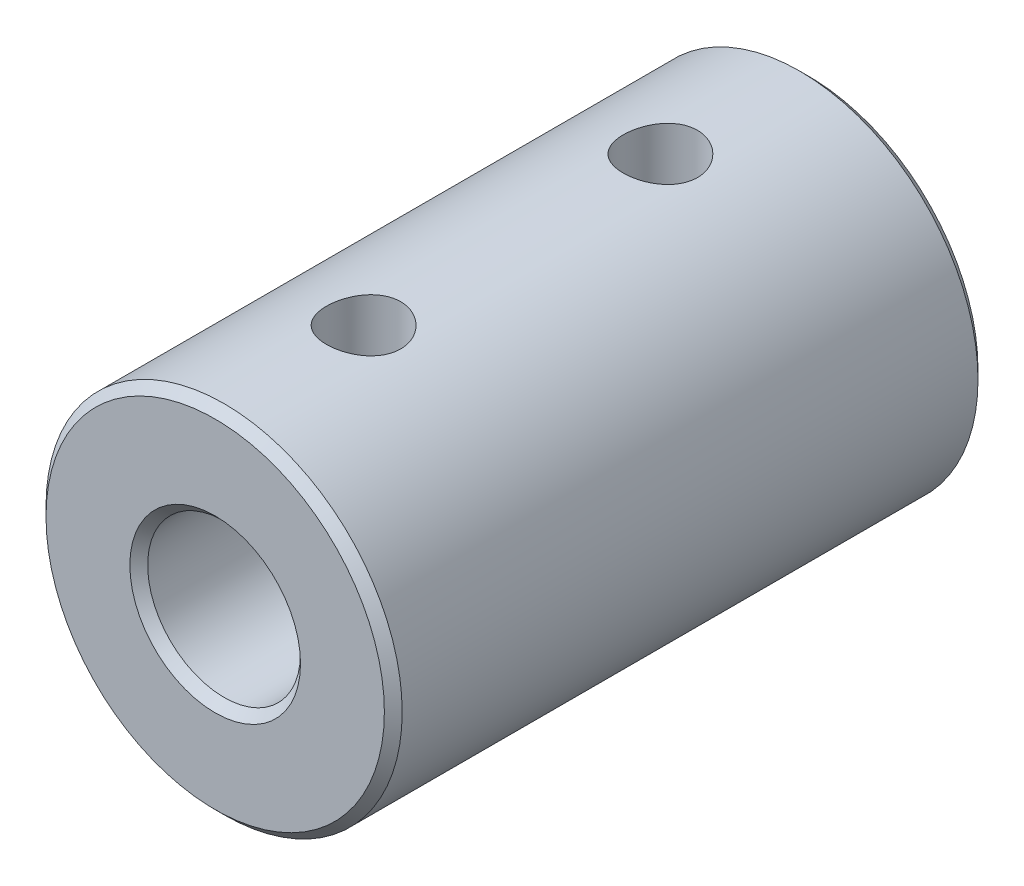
ISO-10303-21;
HEADER;
FILE_DESCRIPTION(('STEP AP214'),'2;1');
FILE_NAME('part.step','',(''),(''),'','','');
FILE_SCHEMA(('AUTOMOTIVE_DESIGN { 1 0 10303 214 1 1 1 1 }'));
ENDSEC;
DATA;
#1=APPLICATION_CONTEXT('core data for automotive mechanical design processes');
#2=APPLICATION_PROTOCOL_DEFINITION('international standard','automotive_design',2000,#1);
#3=PRODUCT_CONTEXT('',#1,'mechanical');
#4=PRODUCT('Part','Part','',(#3));
#5=PRODUCT_RELATED_PRODUCT_CATEGORY('part','',(#4));
#6=PRODUCT_DEFINITION_FORMATION('','',#4);
#7=PRODUCT_DEFINITION_CONTEXT('part definition',#1,'design');
#8=PRODUCT_DEFINITION('design','',#6,#7);
#9=PRODUCT_DEFINITION_SHAPE('','',#8);
#10=(LENGTH_UNIT() NAMED_UNIT(*) SI_UNIT(.MILLI.,.METRE.));
#11=(NAMED_UNIT(*) PLANE_ANGLE_UNIT() SI_UNIT($,.RADIAN.));
#12=(NAMED_UNIT(*) SI_UNIT($,.STERADIAN.) SOLID_ANGLE_UNIT());
#13=UNCERTAINTY_MEASURE_WITH_UNIT(LENGTH_MEASURE(1.E-05),#10,'distance_accuracy_value','');
#14=(GEOMETRIC_REPRESENTATION_CONTEXT(3) GLOBAL_UNCERTAINTY_ASSIGNED_CONTEXT((#13)) GLOBAL_UNIT_ASSIGNED_CONTEXT((#10,
#11,#12)) REPRESENTATION_CONTEXT('',''));
#15=CARTESIAN_POINT('',(0.,0.,0.));
#16=DIRECTION('',(0.,0.,1.));
#17=DIRECTION('',(1.,0.,0.));
#18=AXIS2_PLACEMENT_3D('',#15,#16,#17);
#19=CARTESIAN_POINT('',(0.,0.,10.));
#20=DIRECTION('',(0.,0.,-1.));
#21=DIRECTION('',(-1.,0.,0.));
#22=AXIS2_PLACEMENT_3D('',#19,#20,#21);
#23=CYLINDRICAL_SURFACE('',#22,2.075);
#24=CARTESIAN_POINT('',(0.,0.,-9.7));
#25=DIRECTION('',(0.,0.,1.));
#26=DIRECTION('',(1.,0.,0.));
#27=AXIS2_PLACEMENT_3D('',#24,#25,#26);
#28=CIRCLE('',#27,2.075);
#29=CARTESIAN_POINT('',(2.075,0.,-9.7));
#30=VERTEX_POINT('',#29);
#31=EDGE_CURVE('E45',#30,#30,#28,.F.);
#32=ORIENTED_EDGE('',*,*,#31,.T.);
#33=EDGE_LOOP('',(#32));
#34=FACE_BOUND('',#33,.T.);
#35=CARTESIAN_POINT('',(0.,-2.075,-3.75));
#36=CARTESIAN_POINT('',(0.0639003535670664,-2.07499675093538,-3.75000354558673));
#37=CARTESIAN_POINT('',(0.127900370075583,-2.07201621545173,-3.75493410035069));
#38=CARTESIAN_POINT('',(0.253971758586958,-2.06037700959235,-3.77440328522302));
#39=CARTESIAN_POINT('',(0.316038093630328,-2.05170462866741,-3.78896511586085));
#40=CARTESIAN_POINT('',(0.43614930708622,-2.02955917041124,-3.82687586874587));
#41=CARTESIAN_POINT('',(0.494212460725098,-2.01610991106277,-3.85018122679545));
#42=CARTESIAN_POINT('',(0.605419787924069,-1.98555335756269,-3.90464418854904));
#43=CARTESIAN_POINT('',(0.658565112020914,-1.96844692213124,-3.93579994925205));
#44=CARTESIAN_POINT('',(0.763048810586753,-1.93046711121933,-4.00773802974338));
#45=CARTESIAN_POINT('',(0.813934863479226,-1.90940532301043,-4.04907594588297));
#46=CARTESIAN_POINT('',(0.908493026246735,-1.86627238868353,-4.13895215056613));
#47=CARTESIAN_POINT('',(0.952155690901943,-1.84419996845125,-4.18749971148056));
#48=CARTESIAN_POINT('',(1.03651378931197,-1.79828874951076,-4.29748885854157));
#49=CARTESIAN_POINT('',(1.07617227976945,-1.77456967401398,-4.35978268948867));
#50=CARTESIAN_POINT('',(1.14431226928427,-1.7314178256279,-4.49154484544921));
#51=CARTESIAN_POINT('',(1.17281199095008,-1.71197808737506,-4.56100123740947));
#52=CARTESIAN_POINT('',(1.21175925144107,-1.68454393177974,-4.68789473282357));
#53=CARTESIAN_POINT('',(1.22491141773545,-1.6749158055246,-4.74414690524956));
#54=CARTESIAN_POINT('',(1.24331991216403,-1.66129972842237,-4.85856966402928));
#55=CARTESIAN_POINT('',(1.24858618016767,-1.65730467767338,-4.91673774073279));
#56=CARTESIAN_POINT('',(1.25091758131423,-1.65554620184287,-5.03345301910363));
#57=CARTESIAN_POINT('',(1.24796614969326,-1.65779536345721,-5.09200074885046));
#58=CARTESIAN_POINT('',(1.23401615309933,-1.66820280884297,-5.20760541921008));
#59=CARTESIAN_POINT('',(1.22301149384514,-1.67636556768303,-5.26466119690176));
#60=CARTESIAN_POINT('',(1.19375104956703,-1.69732069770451,-5.37507258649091));
#61=CARTESIAN_POINT('',(1.1755973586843,-1.71004766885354,-5.42846837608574));
#62=CARTESIAN_POINT('',(1.13270947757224,-1.73875205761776,-5.53159388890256));
#63=CARTESIAN_POINT('',(1.10797288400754,-1.75473066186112,-5.58132226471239));
#64=CARTESIAN_POINT('',(1.04760481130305,-1.79153730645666,-5.68500277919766));
#65=CARTESIAN_POINT('',(1.01082201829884,-1.81272387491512,-5.73815758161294));
#66=CARTESIAN_POINT('',(0.929648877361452,-1.85566442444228,-5.83809516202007));
#67=CARTESIAN_POINT('',(0.885251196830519,-1.87741893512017,-5.88487171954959));
#68=CARTESIAN_POINT('',(0.782633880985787,-1.92267490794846,-5.97744995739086));
#69=CARTESIAN_POINT('',(0.723347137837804,-1.94598713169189,-6.02217435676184));
#70=CARTESIAN_POINT('',(0.596692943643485,-1.98847524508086,-6.10091165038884));
#71=CARTESIAN_POINT('',(0.529329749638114,-2.00765329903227,-6.13493015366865));
#72=CARTESIAN_POINT('',(0.392621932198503,-2.03864449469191,-6.18886586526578));
#73=CARTESIAN_POINT('',(0.323662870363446,-2.05084235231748,-6.20953017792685));
#74=CARTESIAN_POINT('',(0.182389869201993,-2.0681879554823,-6.23871626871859));
#75=CARTESIAN_POINT('',(0.110080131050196,-2.07334429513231,-6.24725284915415));
#76=CARTESIAN_POINT('',(-0.0250714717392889,-2.07579635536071,-6.2513206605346));
#77=CARTESIAN_POINT('',(-0.0878532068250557,-2.07407223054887,-6.24847344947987));
#78=CARTESIAN_POINT('',(-0.211885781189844,-2.06508910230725,-6.23349281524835));
#79=CARTESIAN_POINT('',(-0.273136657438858,-2.05783023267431,-6.22135961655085));
#80=CARTESIAN_POINT('',(-0.390883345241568,-2.03870238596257,-6.18884363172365));
#81=CARTESIAN_POINT('',(-0.447460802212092,-2.02695636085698,-6.16868030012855));
#82=CARTESIAN_POINT('',(-0.556413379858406,-1.9997962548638,-6.1209128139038));
#83=CARTESIAN_POINT('',(-0.608787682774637,-1.98438146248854,-6.09330721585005));
#84=CARTESIAN_POINT('',(-0.713716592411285,-1.94925706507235,-6.02825345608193));
#85=CARTESIAN_POINT('',(-0.765727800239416,-1.92926796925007,-5.99008191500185));
#86=CARTESIAN_POINT('',(-0.862998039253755,-1.88776650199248,-5.90656042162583));
#87=CARTESIAN_POINT('',(-0.908249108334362,-1.86625237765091,-5.86120213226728));
#88=CARTESIAN_POINT('',(-0.996859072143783,-1.82062975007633,-5.75763524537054));
#89=CARTESIAN_POINT('',(-1.03918213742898,-1.79655311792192,-5.6985208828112));
#90=CARTESIAN_POINT('',(-1.11333940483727,-1.75156624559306,-5.57295504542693));
#91=CARTESIAN_POINT('',(-1.14518433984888,-1.73065277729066,-5.50651117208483));
#92=CARTESIAN_POINT('',(-1.19144400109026,-1.69902821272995,-5.38254710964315));
#93=CARTESIAN_POINT('',(-1.2081368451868,-1.68708947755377,-5.32619377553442));
#94=CARTESIAN_POINT('',(-1.23349271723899,-1.66864368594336,-5.21087708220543));
#95=CARTESIAN_POINT('',(-1.24216703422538,-1.6621289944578,-5.15191751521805));
#96=CARTESIAN_POINT('',(-1.25100290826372,-1.65549118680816,-5.03275428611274));
#97=CARTESIAN_POINT('',(-1.25113100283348,-1.6553931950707,-4.97254665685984));
#98=CARTESIAN_POINT('',(-1.24277909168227,-1.66167063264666,-4.85306170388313));
#99=CARTESIAN_POINT('',(-1.23429452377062,-1.66804949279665,-4.79378489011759));
#100=CARTESIAN_POINT('',(-1.20988510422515,-1.68582696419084,-4.68086335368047));
#101=CARTESIAN_POINT('',(-1.19436244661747,-1.69695251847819,-4.62708560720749));
#102=CARTESIAN_POINT('',(-1.15668122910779,-1.72285648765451,-4.52285931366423));
#103=CARTESIAN_POINT('',(-1.13452016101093,-1.73763628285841,-4.47241203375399));
#104=CARTESIAN_POINT('',(-1.08029882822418,-1.77193588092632,-4.36799877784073));
#105=CARTESIAN_POINT('',(-1.04724260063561,-1.79183493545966,-4.31467595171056));
#106=CARTESIAN_POINT('',(-0.973804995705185,-1.83278457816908,-4.21380557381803));
#107=CARTESIAN_POINT('',(-0.933417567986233,-1.85383610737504,-4.16626284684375));
#108=CARTESIAN_POINT('',(-0.838561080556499,-1.89885036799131,-4.07016155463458));
#109=CARTESIAN_POINT('',(-0.782866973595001,-1.92271365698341,-4.02275387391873));
#110=CARTESIAN_POINT('',(-0.663137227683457,-1.96721845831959,-3.93786586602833));
#111=CARTESIAN_POINT('',(-0.599098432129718,-1.9878587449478,-3.90038931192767));
#112=CARTESIAN_POINT('',(-0.465975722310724,-2.02314123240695,-3.83783674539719));
#113=CARTESIAN_POINT('',(-0.397081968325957,-2.0379344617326,-3.81244446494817));
#114=CARTESIAN_POINT('',(-0.25496190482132,-2.06052123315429,-3.77408520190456));
#115=CARTESIAN_POINT('',(-0.181752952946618,-2.06834101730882,-3.76107162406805));
#116=CARTESIAN_POINT('',(-0.0899873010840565,-2.07312691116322,-3.75311193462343));
#117=CARTESIAN_POINT('',(-0.0720195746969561,-2.07382798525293,-3.75194641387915));
#118=CARTESIAN_POINT('',(-0.0360372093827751,-2.07476499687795,-3.7503899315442));
#119=CARTESIAN_POINT('',(-0.0180225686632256,-2.07500091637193,-3.74999899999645));
#120=CARTESIAN_POINT('',(0.,-2.075,-3.75));
#121=B_SPLINE_CURVE_WITH_KNOTS('',3,(#35,#36,#37,#38,#39,#40,#41,#42,#43,#44,#45,#46,#47,#48,
#49,#50,#51,#52,#53,#54,#55,#56,#57,#58,#59,#60,#61,#62,#63,#64,#65,#66,#67,#68,#69,#70,#71,#72,
#73,#74,#75,#76,#77,#78,#79,#80,#81,#82,#83,#84,#85,#86,#87,#88,#89,#90,#91,#92,#93,#94,#95,#96,
#97,#98,#99,#100,#101,#102,#103,#104,#105,#106,#107,#108,#109,#110,#111,#112,#113,#114,#115,
#116,#117,#118,#119,#120),.UNSPECIFIED.,.T.,.F.,(4,2,2,2,2,2,2,2,2,2,2,2,2,2,2,2,2,2,2,2,2,2,2,
2,2,2,2,2,2,2,2,2,2,2,2,2,2,2,2,2,2,2,4),(0.,0.191623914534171,0.383711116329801,
0.574853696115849,0.76595144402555,0.971727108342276,1.17776975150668,1.40932655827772,
1.64050363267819,1.81545910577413,1.99019386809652,2.16528110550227,2.34050097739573,
2.51330437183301,2.68617094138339,2.88946635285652,3.09295863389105,3.32528461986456,
3.55748868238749,3.77521161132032,3.99266857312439,4.18033294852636,4.36799278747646,
4.55084190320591,4.73372650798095,4.93555705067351,5.13762346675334,5.36632769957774,
5.59479693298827,5.77398195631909,5.95291432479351,6.13254725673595,6.31227539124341,
6.48282286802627,6.65343486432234,6.85015894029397,7.04704611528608,7.27674197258,
7.50652497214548,7.72990894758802,7.95244870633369,8.0064925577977,8.06053850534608),.UNSPECIFIED.);
#122=CARTESIAN_POINT('',(0.,-2.075,-3.75));
#123=VERTEX_POINT('',#122);
#124=EDGE_CURVE('E97',#123,#123,#121,.T.);
#125=ORIENTED_EDGE('',*,*,#124,.F.);
#126=EDGE_LOOP('',(#125));
#127=FACE_BOUND('',#126,.T.);
#128=CARTESIAN_POINT('',(0.,2.075,-3.75));
#129=CARTESIAN_POINT('',(-0.0639003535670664,2.07499675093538,-3.75000354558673));
#130=CARTESIAN_POINT('',(-0.127900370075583,2.07201621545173,-3.75493410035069));
#131=CARTESIAN_POINT('',(-0.253971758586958,2.06037700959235,-3.77440328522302));
#132=CARTESIAN_POINT('',(-0.316038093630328,2.05170462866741,-3.78896511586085));
#133=CARTESIAN_POINT('',(-0.43614930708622,2.02955917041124,-3.82687586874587));
#134=CARTESIAN_POINT('',(-0.494212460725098,2.01610991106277,-3.85018122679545));
#135=CARTESIAN_POINT('',(-0.605419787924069,1.98555335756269,-3.90464418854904));
#136=CARTESIAN_POINT('',(-0.658565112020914,1.96844692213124,-3.93579994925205));
#137=CARTESIAN_POINT('',(-0.763048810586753,1.93046711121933,-4.00773802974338));
#138=CARTESIAN_POINT('',(-0.813934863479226,1.90940532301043,-4.04907594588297));
#139=CARTESIAN_POINT('',(-0.908493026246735,1.86627238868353,-4.13895215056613));
#140=CARTESIAN_POINT('',(-0.952155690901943,1.84419996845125,-4.18749971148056));
#141=CARTESIAN_POINT('',(-1.03651378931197,1.79828874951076,-4.29748885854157));
#142=CARTESIAN_POINT('',(-1.07617227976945,1.77456967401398,-4.35978268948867));
#143=CARTESIAN_POINT('',(-1.14431226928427,1.7314178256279,-4.49154484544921));
#144=CARTESIAN_POINT('',(-1.17281199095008,1.71197808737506,-4.56100123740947));
#145=CARTESIAN_POINT('',(-1.21175925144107,1.68454393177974,-4.68789473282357));
#146=CARTESIAN_POINT('',(-1.22491141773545,1.6749158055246,-4.74414690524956));
#147=CARTESIAN_POINT('',(-1.24331991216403,1.66129972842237,-4.85856966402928));
#148=CARTESIAN_POINT('',(-1.24858618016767,1.65730467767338,-4.91673774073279));
#149=CARTESIAN_POINT('',(-1.25091758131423,1.65554620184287,-5.03345301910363));
#150=CARTESIAN_POINT('',(-1.24796614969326,1.65779536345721,-5.09200074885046));
#151=CARTESIAN_POINT('',(-1.23401615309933,1.66820280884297,-5.20760541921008));
#152=CARTESIAN_POINT('',(-1.22301149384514,1.67636556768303,-5.26466119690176));
#153=CARTESIAN_POINT('',(-1.19375104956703,1.69732069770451,-5.37507258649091));
#154=CARTESIAN_POINT('',(-1.1755973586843,1.71004766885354,-5.42846837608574));
#155=CARTESIAN_POINT('',(-1.13270947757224,1.73875205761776,-5.53159388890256));
#156=CARTESIAN_POINT('',(-1.10797288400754,1.75473066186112,-5.58132226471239));
#157=CARTESIAN_POINT('',(-1.04760481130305,1.79153730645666,-5.68500277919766));
#158=CARTESIAN_POINT('',(-1.01082201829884,1.81272387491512,-5.73815758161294));
#159=CARTESIAN_POINT('',(-0.929648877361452,1.85566442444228,-5.83809516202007));
#160=CARTESIAN_POINT('',(-0.885251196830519,1.87741893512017,-5.88487171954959));
#161=CARTESIAN_POINT('',(-0.782633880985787,1.92267490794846,-5.97744995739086));
#162=CARTESIAN_POINT('',(-0.723347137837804,1.94598713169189,-6.02217435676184));
#163=CARTESIAN_POINT('',(-0.596692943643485,1.98847524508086,-6.10091165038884));
#164=CARTESIAN_POINT('',(-0.529329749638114,2.00765329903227,-6.13493015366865));
#165=CARTESIAN_POINT('',(-0.392621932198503,2.03864449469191,-6.18886586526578));
#166=CARTESIAN_POINT('',(-0.323662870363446,2.05084235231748,-6.20953017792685));
#167=CARTESIAN_POINT('',(-0.182389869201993,2.0681879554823,-6.23871626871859));
#168=CARTESIAN_POINT('',(-0.110080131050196,2.07334429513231,-6.24725284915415));
#169=CARTESIAN_POINT('',(0.0250714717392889,2.07579635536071,-6.2513206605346));
#170=CARTESIAN_POINT('',(0.0878532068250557,2.07407223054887,-6.24847344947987));
#171=CARTESIAN_POINT('',(0.211885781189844,2.06508910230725,-6.23349281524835));
#172=CARTESIAN_POINT('',(0.273136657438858,2.05783023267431,-6.22135961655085));
#173=CARTESIAN_POINT('',(0.390883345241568,2.03870238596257,-6.18884363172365));
#174=CARTESIAN_POINT('',(0.447460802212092,2.02695636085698,-6.16868030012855));
#175=CARTESIAN_POINT('',(0.556413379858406,1.9997962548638,-6.1209128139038));
#176=CARTESIAN_POINT('',(0.608787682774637,1.98438146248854,-6.09330721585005));
#177=CARTESIAN_POINT('',(0.713716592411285,1.94925706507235,-6.02825345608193));
#178=CARTESIAN_POINT('',(0.765727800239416,1.92926796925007,-5.99008191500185));
#179=CARTESIAN_POINT('',(0.862998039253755,1.88776650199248,-5.90656042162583));
#180=CARTESIAN_POINT('',(0.908249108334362,1.86625237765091,-5.86120213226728));
#181=CARTESIAN_POINT('',(0.996859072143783,1.82062975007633,-5.75763524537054));
#182=CARTESIAN_POINT('',(1.03918213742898,1.79655311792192,-5.6985208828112));
#183=CARTESIAN_POINT('',(1.11333940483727,1.75156624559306,-5.57295504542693));
#184=CARTESIAN_POINT('',(1.14518433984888,1.73065277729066,-5.50651117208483));
#185=CARTESIAN_POINT('',(1.19144400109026,1.69902821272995,-5.38254710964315));
#186=CARTESIAN_POINT('',(1.2081368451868,1.68708947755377,-5.32619377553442));
#187=CARTESIAN_POINT('',(1.23349271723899,1.66864368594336,-5.21087708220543));
#188=CARTESIAN_POINT('',(1.24216703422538,1.6621289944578,-5.15191751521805));
#189=CARTESIAN_POINT('',(1.25100290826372,1.65549118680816,-5.03275428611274));
#190=CARTESIAN_POINT('',(1.25113100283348,1.6553931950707,-4.97254665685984));
#191=CARTESIAN_POINT('',(1.24277909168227,1.66167063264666,-4.85306170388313));
#192=CARTESIAN_POINT('',(1.23429452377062,1.66804949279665,-4.79378489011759));
#193=CARTESIAN_POINT('',(1.20988510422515,1.68582696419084,-4.68086335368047));
#194=CARTESIAN_POINT('',(1.19436244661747,1.69695251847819,-4.62708560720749));
#195=CARTESIAN_POINT('',(1.15668122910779,1.72285648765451,-4.52285931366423));
#196=CARTESIAN_POINT('',(1.13452016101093,1.73763628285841,-4.47241203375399));
#197=CARTESIAN_POINT('',(1.08029882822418,1.77193588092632,-4.36799877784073));
#198=CARTESIAN_POINT('',(1.04724260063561,1.79183493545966,-4.31467595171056));
#199=CARTESIAN_POINT('',(0.973804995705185,1.83278457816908,-4.21380557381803));
#200=CARTESIAN_POINT('',(0.933417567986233,1.85383610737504,-4.16626284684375));
#201=CARTESIAN_POINT('',(0.838561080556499,1.89885036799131,-4.07016155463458));
#202=CARTESIAN_POINT('',(0.782866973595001,1.92271365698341,-4.02275387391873));
#203=CARTESIAN_POINT('',(0.663137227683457,1.96721845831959,-3.93786586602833));
#204=CARTESIAN_POINT('',(0.599098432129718,1.9878587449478,-3.90038931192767));
#205=CARTESIAN_POINT('',(0.465975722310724,2.02314123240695,-3.83783674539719));
#206=CARTESIAN_POINT('',(0.397081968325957,2.0379344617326,-3.81244446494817));
#207=CARTESIAN_POINT('',(0.25496190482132,2.06052123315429,-3.77408520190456));
#208=CARTESIAN_POINT('',(0.181752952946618,2.06834101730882,-3.76107162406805));
#209=CARTESIAN_POINT('',(0.0899873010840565,2.07312691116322,-3.75311193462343));
#210=CARTESIAN_POINT('',(0.0720195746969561,2.07382798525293,-3.75194641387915));
#211=CARTESIAN_POINT('',(0.0360372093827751,2.07476499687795,-3.7503899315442));
#212=CARTESIAN_POINT('',(0.0180225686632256,2.07500091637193,-3.74999899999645));
#213=CARTESIAN_POINT('',(0.,2.075,-3.75));
#214=B_SPLINE_CURVE_WITH_KNOTS('',3,(#128,#129,#130,#131,#132,#133,#134,#135,#136,#137,#138,
#139,#140,#141,#142,#143,#144,#145,#146,#147,#148,#149,#150,#151,#152,#153,#154,#155,#156,#157,
#158,#159,#160,#161,#162,#163,#164,#165,#166,#167,#168,#169,#170,#171,#172,#173,#174,#175,#176,
#177,#178,#179,#180,#181,#182,#183,#184,#185,#186,#187,#188,#189,#190,#191,#192,#193,#194,#195,
#196,#197,#198,#199,#200,#201,#202,#203,#204,#205,#206,#207,#208,#209,#210,#211,#212,#213),
.UNSPECIFIED.,.T.,.F.,(4,2,2,2,2,2,2,2,2,2,2,2,2,2,2,2,2,2,2,2,2,2,2,2,2,2,2,2,2,2,2,2,2,2,2,2,
2,2,2,2,2,2,4),(0.,0.191623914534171,0.383711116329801,0.574853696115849,0.76595144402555,
0.971727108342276,1.17776975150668,1.40932655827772,1.64050363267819,1.81545910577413,
1.99019386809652,2.16528110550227,2.34050097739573,2.51330437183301,2.68617094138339,
2.88946635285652,3.09295863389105,3.32528461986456,3.55748868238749,3.77521161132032,
3.99266857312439,4.18033294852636,4.36799278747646,4.55084190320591,4.73372650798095,
4.93555705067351,5.13762346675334,5.36632769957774,5.59479693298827,5.77398195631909,
5.95291432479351,6.13254725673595,6.31227539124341,6.48282286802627,6.65343486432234,
6.85015894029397,7.04704611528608,7.27674197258,7.50652497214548,7.72990894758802,
7.95244870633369,8.0064925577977,8.06053850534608),.UNSPECIFIED.);
#215=CARTESIAN_POINT('',(0.,2.075,-3.75));
#216=VERTEX_POINT('',#215);
#217=EDGE_CURVE('E92',#216,#216,#214,.T.);
#218=ORIENTED_EDGE('',*,*,#217,.F.);
#219=EDGE_LOOP('',(#218));
#220=FACE_BOUND('',#219,.T.);
#221=CARTESIAN_POINT('',(0.,0.,0.));
#222=DIRECTION('',(0.,0.,1.));
#223=DIRECTION('',(1.,0.,0.));
#224=AXIS2_PLACEMENT_3D('',#221,#222,#223);
#225=CIRCLE('',#224,2.075);
#226=CARTESIAN_POINT('',(2.075,0.,0.));
#227=VERTEX_POINT('',#226);
#228=EDGE_CURVE('E142',#227,#227,#225,.T.);
#229=ORIENTED_EDGE('',*,*,#228,.T.);
#230=EDGE_LOOP('',(#229));
#231=FACE_BOUND('',#230,.T.);
#232=ADVANCED_FACE('F30',(#34,#127,#220,#231),#23,.F.);
#233=CARTESIAN_POINT('',(0.,0.,10.));
#234=DIRECTION('',(0.,0.,1.));
#235=DIRECTION('',(1.,0.,0.));
#236=AXIS2_PLACEMENT_3D('',#233,#234,#235);
#237=PLANE('',#236);
#238=CARTESIAN_POINT('',(0.,0.,10.));
#239=DIRECTION('',(0.,0.,1.));
#240=DIRECTION('',(1.,0.,0.));
#241=AXIS2_PLACEMENT_3D('',#238,#239,#240);
#242=CIRCLE('',#241,2.87500000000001);
#243=CARTESIAN_POINT('',(2.87500000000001,0.,10.));
#244=VERTEX_POINT('',#243);
#245=EDGE_CURVE('E10',#244,#244,#242,.F.);
#246=ORIENTED_EDGE('',*,*,#245,.T.);
#247=EDGE_LOOP('',(#246));
#248=FACE_BOUND('',#247,.T.);
#249=CARTESIAN_POINT('',(0.,0.,10.));
#250=DIRECTION('',(0.,0.,1.));
#251=DIRECTION('',(1.,0.,0.));
#252=AXIS2_PLACEMENT_3D('',#249,#250,#251);
#253=CIRCLE('',#252,5.7);
#254=CARTESIAN_POINT('',(-5.7,0.,10.));
#255=VERTEX_POINT('',#254);
#256=EDGE_CURVE('E37',#255,#255,#253,.T.);
#257=ORIENTED_EDGE('',*,*,#256,.T.);
#258=EDGE_LOOP('',(#257));
#259=FACE_BOUND('',#258,.T.);
#260=ADVANCED_FACE('F105',(#248,#259),#237,.T.);
#261=CARTESIAN_POINT('',(0.,0.,-10.));
#262=DIRECTION('',(0.,0.,1.));
#263=DIRECTION('',(1.,0.,0.));
#264=AXIS2_PLACEMENT_3D('',#261,#262,#263);
#265=PLANE('',#264);
#266=CARTESIAN_POINT('',(0.,0.,-10.));
#267=DIRECTION('',(0.,0.,1.));
#268=DIRECTION('',(1.,0.,0.));
#269=AXIS2_PLACEMENT_3D('',#266,#267,#268);
#270=CIRCLE('',#269,5.7);
#271=CARTESIAN_POINT('',(5.7,0.,-10.));
#272=VERTEX_POINT('',#271);
#273=EDGE_CURVE('E50',#272,#272,#270,.F.);
#274=ORIENTED_EDGE('',*,*,#273,.T.);
#275=EDGE_LOOP('',(#274));
#276=FACE_BOUND('',#275,.T.);
#277=CARTESIAN_POINT('',(0.,0.,-10.));
#278=DIRECTION('',(0.,0.,1.));
#279=DIRECTION('',(1.,0.,0.));
#280=AXIS2_PLACEMENT_3D('',#277,#278,#279);
#281=CIRCLE('',#280,2.375);
#282=CARTESIAN_POINT('',(2.375,0.,-10.));
#283=VERTEX_POINT('',#282);
#284=EDGE_CURVE('E53',#283,#283,#281,.T.);
#285=ORIENTED_EDGE('',*,*,#284,.T.);
#286=EDGE_LOOP('',(#285));
#287=FACE_BOUND('',#286,.T.);
#288=ADVANCED_FACE('F111',(#276,#287),#265,.F.);
#289=CARTESIAN_POINT('',(0.,0.,10.));
#290=DIRECTION('',(0.,0.,-1.));
#291=DIRECTION('',(-1.,0.,0.));
#292=AXIS2_PLACEMENT_3D('',#289,#290,#291);
#293=CYLINDRICAL_SURFACE('',#292,6.);
#294=CARTESIAN_POINT('',(0.,0.,-9.7));
#295=DIRECTION('',(0.,0.,1.));
#296=DIRECTION('',(1.,0.,0.));
#297=AXIS2_PLACEMENT_3D('',#294,#295,#296);
#298=CIRCLE('',#297,6.);
#299=CARTESIAN_POINT('',(6.,0.,-9.7));
#300=VERTEX_POINT('',#299);
#301=EDGE_CURVE('E56',#300,#300,#298,.T.);
#302=ORIENTED_EDGE('',*,*,#301,.T.);
#303=EDGE_LOOP('',(#302));
#304=FACE_BOUND('',#303,.T.);
#305=CARTESIAN_POINT('',(0.,0.,9.7));
#306=DIRECTION('',(0.,0.,1.));
#307=DIRECTION('',(1.,0.,0.));
#308=AXIS2_PLACEMENT_3D('',#305,#306,#307);
#309=CIRCLE('',#308,6.);
#310=CARTESIAN_POINT('',(-6.,0.,9.7));
#311=VERTEX_POINT('',#310);
#312=EDGE_CURVE('E59',#311,#311,#309,.F.);
#313=ORIENTED_EDGE('',*,*,#312,.T.);
#314=EDGE_LOOP('',(#313));
#315=FACE_BOUND('',#314,.T.);
#316=CARTESIAN_POINT('',(0.,-6.,-3.75));
#317=CARTESIAN_POINT('',(0.0694090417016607,-5.99999871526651,-3.75000247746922));
#318=CARTESIAN_POINT('',(0.138848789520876,-5.99878328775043,-3.75580066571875));
#319=CARTESIAN_POINT('',(0.275761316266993,-5.9940520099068,-3.77881934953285));
#320=CARTESIAN_POINT('',(0.343232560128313,-5.99053441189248,-3.79604852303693));
#321=CARTESIAN_POINT('',(0.474209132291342,-5.98159109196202,-3.84137045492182));
#322=CARTESIAN_POINT('',(0.537718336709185,-5.97616727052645,-3.86945239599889));
#323=CARTESIAN_POINT('',(0.659120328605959,-5.96399927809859,-3.93564960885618));
#324=CARTESIAN_POINT('',(0.717013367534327,-5.95725516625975,-3.97376443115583));
#325=CARTESIAN_POINT('',(0.826390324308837,-5.9430770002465,-4.05953634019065));
#326=CARTESIAN_POINT('',(0.877780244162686,-5.93563505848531,-4.10731200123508));
#327=CARTESIAN_POINT('',(0.971877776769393,-5.92095657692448,-4.21079465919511));
#328=CARTESIAN_POINT('',(1.01458467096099,-5.91372005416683,-4.26650231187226));
#329=CARTESIAN_POINT('',(1.09051031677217,-5.90019442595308,-4.38495196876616));
#330=CARTESIAN_POINT('',(1.12363054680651,-5.89391545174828,-4.44775838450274));
#331=CARTESIAN_POINT('',(1.17881119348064,-5.8831284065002,-4.57819745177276));
#332=CARTESIAN_POINT('',(1.20087280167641,-5.87862014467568,-4.64582958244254));
#333=CARTESIAN_POINT('',(1.23300240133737,-5.87196500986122,-4.78298523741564));
#334=CARTESIAN_POINT('',(1.24323597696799,-5.86978556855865,-4.85246835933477));
#335=CARTESIAN_POINT('',(1.25193357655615,-5.86793690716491,-4.99219684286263));
#336=CARTESIAN_POINT('',(1.25039890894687,-5.86826740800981,-5.0624421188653));
#337=CARTESIAN_POINT('',(1.23573719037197,-5.87137174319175,-5.20048102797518));
#338=CARTESIAN_POINT('',(1.2228010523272,-5.87410533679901,-5.26829597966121));
#339=CARTESIAN_POINT('',(1.18600543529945,-5.88164437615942,-5.40077150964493));
#340=CARTESIAN_POINT('',(1.16214539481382,-5.88644992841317,-5.46543192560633));
#341=CARTESIAN_POINT('',(1.10400003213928,-5.89763191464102,-5.59030722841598));
#342=CARTESIAN_POINT('',(1.06964002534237,-5.90401953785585,-5.65048629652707));
#343=CARTESIAN_POINT('',(0.991522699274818,-5.91763890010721,-5.76429574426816));
#344=CARTESIAN_POINT('',(0.947764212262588,-5.92487074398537,-5.81792530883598));
#345=CARTESIAN_POINT('',(0.851074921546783,-5.93953730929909,-5.91821396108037));
#346=CARTESIAN_POINT('',(0.797981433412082,-5.94697323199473,-5.96471616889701));
#347=CARTESIAN_POINT('',(0.684667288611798,-5.96108088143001,-6.04818044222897));
#348=CARTESIAN_POINT('',(0.624446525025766,-5.96775259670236,-6.0851423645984));
#349=CARTESIAN_POINT('',(0.498405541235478,-5.97959870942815,-6.14851008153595));
#350=CARTESIAN_POINT('',(0.4325754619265,-5.98477039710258,-6.17489680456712));
#351=CARTESIAN_POINT('',(0.297284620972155,-5.99301338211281,-6.21619170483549));
#352=CARTESIAN_POINT('',(0.227824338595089,-5.99608495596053,-6.2311013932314));
#353=CARTESIAN_POINT('',(0.0885918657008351,-5.99974275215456,-6.24879425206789));
#354=CARTESIAN_POINT('',(0.0188480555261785,-6.00037293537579,-6.25179194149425));
#355=CARTESIAN_POINT('',(-0.120143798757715,-5.99919952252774,-6.2461550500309));
#356=CARTESIAN_POINT('',(-0.189391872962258,-5.99739607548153,-6.2375211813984));
#357=CARTESIAN_POINT('',(-0.324726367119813,-5.99158564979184,-6.20904434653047));
#358=CARTESIAN_POINT('',(-0.390837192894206,-5.98760052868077,-6.18931251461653));
#359=CARTESIAN_POINT('',(-0.518811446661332,-5.97787227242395,-6.13932213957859));
#360=CARTESIAN_POINT('',(-0.580674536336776,-5.97212899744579,-6.10906275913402));
#361=CARTESIAN_POINT('',(-0.699294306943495,-5.95941241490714,-6.03841962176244));
#362=CARTESIAN_POINT('',(-0.755973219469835,-5.9524239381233,-5.99790807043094));
#363=CARTESIAN_POINT('',(-0.861805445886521,-5.93802568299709,-5.90808043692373));
#364=CARTESIAN_POINT('',(-0.910957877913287,-5.93061585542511,-5.85876332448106));
#365=CARTESIAN_POINT('',(-1.0011786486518,-5.91606024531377,-5.7517444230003));
#366=CARTESIAN_POINT('',(-1.04209914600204,-5.90892089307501,-5.69391696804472));
#367=CARTESIAN_POINT('',(-1.11364719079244,-5.89585601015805,-5.57208371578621));
#368=CARTESIAN_POINT('',(-1.14427516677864,-5.88993042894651,-5.50807817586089));
#369=CARTESIAN_POINT('',(-1.19417246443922,-5.88001700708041,-5.37603880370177));
#370=CARTESIAN_POINT('',(-1.21350309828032,-5.87601872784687,-5.30802896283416));
#371=CARTESIAN_POINT('',(-1.24044038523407,-5.87039184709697,-5.16963344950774));
#372=CARTESIAN_POINT('',(-1.24804871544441,-5.86876290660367,-5.09924811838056));
#373=CARTESIAN_POINT('',(-1.25125926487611,-5.86807907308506,-4.95958659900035));
#374=CARTESIAN_POINT('',(-1.24709542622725,-5.86897402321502,-4.89031592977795));
#375=CARTESIAN_POINT('',(-1.22739905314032,-5.87312447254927,-4.75348599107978));
#376=CARTESIAN_POINT('',(-1.21186662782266,-5.87637994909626,-4.68592670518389));
#377=CARTESIAN_POINT('',(-1.16998217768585,-5.88486132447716,-4.55460222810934));
#378=CARTESIAN_POINT('',(-1.14366117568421,-5.8900815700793,-4.49082675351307));
#379=CARTESIAN_POINT('',(-1.08097457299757,-5.90190705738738,-4.36856122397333));
#380=CARTESIAN_POINT('',(-1.0446080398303,-5.9085124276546,-4.31007166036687));
#381=CARTESIAN_POINT('',(-0.962073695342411,-5.92251579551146,-4.19887837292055));
#382=CARTESIAN_POINT('',(-0.915737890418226,-5.92992613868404,-4.14630087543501));
#383=CARTESIAN_POINT('',(-0.814924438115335,-5.94461839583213,-4.04959050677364));
#384=CARTESIAN_POINT('',(-0.760444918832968,-5.9519002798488,-4.00545958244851));
#385=CARTESIAN_POINT('',(-0.644134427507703,-5.96561444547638,-3.92641142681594));
#386=CARTESIAN_POINT('',(-0.582225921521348,-5.97203596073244,-3.89160632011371));
#387=CARTESIAN_POINT('',(-0.453319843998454,-5.98319908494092,-3.83294977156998));
#388=CARTESIAN_POINT('',(-0.386326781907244,-5.98794216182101,-3.80908875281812));
#389=CARTESIAN_POINT('',(-0.266015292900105,-5.99432499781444,-3.77745972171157));
#390=CARTESIAN_POINT('',(-0.213367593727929,-5.99644035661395,-3.76718123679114));
#391=CARTESIAN_POINT('',(-0.107152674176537,-5.99927832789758,-3.75345054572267));
#392=CARTESIAN_POINT('',(-0.0535854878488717,-6.00000099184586,-3.74999808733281));
#393=CARTESIAN_POINT('',(0.,-6.,-3.75));
#394=B_SPLINE_CURVE_WITH_KNOTS('',3,(#316,#317,#318,#319,#320,#321,#322,#323,#324,#325,#326,
#327,#328,#329,#330,#331,#332,#333,#334,#335,#336,#337,#338,#339,#340,#341,#342,#343,#344,#345,
#346,#347,#348,#349,#350,#351,#352,#353,#354,#355,#356,#357,#358,#359,#360,#361,#362,#363,#364,
#365,#366,#367,#368,#369,#370,#371,#372,#373,#374,#375,#376,#377,#378,#379,#380,#381,#382,#383,
#384,#385,#386,#387,#388,#389,#390,#391,#392,#393),.UNSPECIFIED.,.T.,.F.,(4,2,2,2,2,2,2,2,2,2,2,
2,2,2,2,2,2,2,2,2,2,2,2,2,2,2,2,2,2,2,2,2,2,2,2,2,2,2,4),(0.,0.208031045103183,
0.416220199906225,0.624202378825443,0.83217524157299,1.04287526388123,1.25359271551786,
1.46640449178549,1.6791933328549,1.88896575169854,2.09871484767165,2.3050171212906,
2.5113300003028,2.71914592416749,2.92698768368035,3.13889526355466,3.35080602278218,
3.56309724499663,3.77536051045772,3.98378339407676,4.19219351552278,4.39855286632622,
4.60492863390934,4.81401583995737,5.02312752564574,5.23571263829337,5.4482888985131,
5.65970050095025,5.87108185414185,6.07829223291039,6.28550062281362,6.49211731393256,
6.6987531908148,6.9091902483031,7.1196757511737,7.33258864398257,7.54531486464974,
7.70592588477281,7.86653096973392),.UNSPECIFIED.);
#395=CARTESIAN_POINT('',(0.,-6.,-3.75));
#396=VERTEX_POINT('',#395);
#397=EDGE_CURVE('E62',#396,#396,#394,.T.);
#398=ORIENTED_EDGE('',*,*,#397,.T.);
#399=EDGE_LOOP('',(#398));
#400=FACE_BOUND('',#399,.T.);
#401=CARTESIAN_POINT('',(0.,6.,-3.75));
#402=CARTESIAN_POINT('',(-0.0694090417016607,5.99999871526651,-3.75000247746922));
#403=CARTESIAN_POINT('',(-0.138848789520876,5.99878328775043,-3.75580066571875));
#404=CARTESIAN_POINT('',(-0.275761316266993,5.9940520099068,-3.77881934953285));
#405=CARTESIAN_POINT('',(-0.343232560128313,5.99053441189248,-3.79604852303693));
#406=CARTESIAN_POINT('',(-0.474209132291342,5.98159109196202,-3.84137045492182));
#407=CARTESIAN_POINT('',(-0.537718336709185,5.97616727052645,-3.86945239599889));
#408=CARTESIAN_POINT('',(-0.659120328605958,5.96399927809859,-3.93564960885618));
#409=CARTESIAN_POINT('',(-0.717013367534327,5.95725516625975,-3.97376443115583));
#410=CARTESIAN_POINT('',(-0.826390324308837,5.9430770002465,-4.05953634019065));
#411=CARTESIAN_POINT('',(-0.877780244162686,5.93563505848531,-4.10731200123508));
#412=CARTESIAN_POINT('',(-0.971877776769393,5.92095657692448,-4.21079465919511));
#413=CARTESIAN_POINT('',(-1.01458467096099,5.91372005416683,-4.26650231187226));
#414=CARTESIAN_POINT('',(-1.09051031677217,5.90019442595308,-4.38495196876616));
#415=CARTESIAN_POINT('',(-1.12363054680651,5.89391545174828,-4.44775838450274));
#416=CARTESIAN_POINT('',(-1.17881119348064,5.8831284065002,-4.57819745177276));
#417=CARTESIAN_POINT('',(-1.20087280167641,5.87862014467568,-4.64582958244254));
#418=CARTESIAN_POINT('',(-1.23300240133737,5.87196500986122,-4.78298523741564));
#419=CARTESIAN_POINT('',(-1.24323597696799,5.86978556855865,-4.85246835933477));
#420=CARTESIAN_POINT('',(-1.25193357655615,5.86793690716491,-4.99219684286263));
#421=CARTESIAN_POINT('',(-1.25039890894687,5.86826740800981,-5.0624421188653));
#422=CARTESIAN_POINT('',(-1.23573719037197,5.87137174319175,-5.20048102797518));
#423=CARTESIAN_POINT('',(-1.2228010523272,5.87410533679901,-5.26829597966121));
#424=CARTESIAN_POINT('',(-1.18600543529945,5.88164437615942,-5.40077150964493));
#425=CARTESIAN_POINT('',(-1.16214539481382,5.88644992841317,-5.46543192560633));
#426=CARTESIAN_POINT('',(-1.10400003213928,5.89763191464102,-5.59030722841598));
#427=CARTESIAN_POINT('',(-1.06964002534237,5.90401953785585,-5.65048629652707));
#428=CARTESIAN_POINT('',(-0.991522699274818,5.91763890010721,-5.76429574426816));
#429=CARTESIAN_POINT('',(-0.947764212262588,5.92487074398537,-5.81792530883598));
#430=CARTESIAN_POINT('',(-0.851074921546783,5.93953730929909,-5.91821396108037));
#431=CARTESIAN_POINT('',(-0.797981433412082,5.94697323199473,-5.96471616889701));
#432=CARTESIAN_POINT('',(-0.684667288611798,5.96108088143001,-6.04818044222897));
#433=CARTESIAN_POINT('',(-0.624446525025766,5.96775259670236,-6.0851423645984));
#434=CARTESIAN_POINT('',(-0.498405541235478,5.97959870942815,-6.14851008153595));
#435=CARTESIAN_POINT('',(-0.4325754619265,5.98477039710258,-6.17489680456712));
#436=CARTESIAN_POINT('',(-0.297284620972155,5.99301338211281,-6.21619170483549));
#437=CARTESIAN_POINT('',(-0.227824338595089,5.99608495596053,-6.2311013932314));
#438=CARTESIAN_POINT('',(-0.0885918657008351,5.99974275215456,-6.24879425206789));
#439=CARTESIAN_POINT('',(-0.0188480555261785,6.00037293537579,-6.25179194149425));
#440=CARTESIAN_POINT('',(0.120143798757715,5.99919952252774,-6.2461550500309));
#441=CARTESIAN_POINT('',(0.189391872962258,5.99739607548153,-6.2375211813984));
#442=CARTESIAN_POINT('',(0.324726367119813,5.99158564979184,-6.20904434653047));
#443=CARTESIAN_POINT('',(0.390837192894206,5.98760052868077,-6.18931251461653));
#444=CARTESIAN_POINT('',(0.518811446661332,5.97787227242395,-6.13932213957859));
#445=CARTESIAN_POINT('',(0.580674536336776,5.97212899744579,-6.10906275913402));
#446=CARTESIAN_POINT('',(0.699294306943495,5.95941241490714,-6.03841962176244));
#447=CARTESIAN_POINT('',(0.755973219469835,5.9524239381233,-5.99790807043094));
#448=CARTESIAN_POINT('',(0.861805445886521,5.93802568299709,-5.90808043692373));
#449=CARTESIAN_POINT('',(0.910957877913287,5.93061585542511,-5.85876332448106));
#450=CARTESIAN_POINT('',(1.0011786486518,5.91606024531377,-5.7517444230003));
#451=CARTESIAN_POINT('',(1.04209914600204,5.90892089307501,-5.69391696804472));
#452=CARTESIAN_POINT('',(1.11364719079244,5.89585601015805,-5.57208371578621));
#453=CARTESIAN_POINT('',(1.14427516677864,5.88993042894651,-5.50807817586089));
#454=CARTESIAN_POINT('',(1.19417246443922,5.88001700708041,-5.37603880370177));
#455=CARTESIAN_POINT('',(1.21350309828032,5.87601872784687,-5.30802896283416));
#456=CARTESIAN_POINT('',(1.24044038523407,5.87039184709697,-5.16963344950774));
#457=CARTESIAN_POINT('',(1.24804871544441,5.86876290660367,-5.09924811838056));
#458=CARTESIAN_POINT('',(1.25125926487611,5.86807907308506,-4.95958659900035));
#459=CARTESIAN_POINT('',(1.24709542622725,5.86897402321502,-4.89031592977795));
#460=CARTESIAN_POINT('',(1.22739905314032,5.87312447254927,-4.75348599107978));
#461=CARTESIAN_POINT('',(1.21186662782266,5.87637994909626,-4.68592670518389));
#462=CARTESIAN_POINT('',(1.16998217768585,5.88486132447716,-4.55460222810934));
#463=CARTESIAN_POINT('',(1.14366117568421,5.8900815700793,-4.49082675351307));
#464=CARTESIAN_POINT('',(1.08097457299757,5.90190705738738,-4.36856122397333));
#465=CARTESIAN_POINT('',(1.0446080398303,5.9085124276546,-4.31007166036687));
#466=CARTESIAN_POINT('',(0.962073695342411,5.92251579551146,-4.19887837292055));
#467=CARTESIAN_POINT('',(0.915737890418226,5.92992613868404,-4.14630087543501));
#468=CARTESIAN_POINT('',(0.814924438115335,5.94461839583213,-4.04959050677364));
#469=CARTESIAN_POINT('',(0.760444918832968,5.9519002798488,-4.00545958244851));
#470=CARTESIAN_POINT('',(0.644134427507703,5.96561444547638,-3.92641142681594));
#471=CARTESIAN_POINT('',(0.582225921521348,5.97203596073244,-3.89160632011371));
#472=CARTESIAN_POINT('',(0.453319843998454,5.98319908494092,-3.83294977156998));
#473=CARTESIAN_POINT('',(0.386326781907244,5.98794216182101,-3.80908875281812));
#474=CARTESIAN_POINT('',(0.266015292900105,5.99432499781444,-3.77745972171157));
#475=CARTESIAN_POINT('',(0.213367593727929,5.99644035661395,-3.76718123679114));
#476=CARTESIAN_POINT('',(0.107152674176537,5.99927832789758,-3.75345054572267));
#477=CARTESIAN_POINT('',(0.0535854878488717,6.00000099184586,-3.74999808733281));
#478=CARTESIAN_POINT('',(0.,6.,-3.75));
#479=B_SPLINE_CURVE_WITH_KNOTS('',3,(#401,#402,#403,#404,#405,#406,#407,#408,#409,#410,#411,
#412,#413,#414,#415,#416,#417,#418,#419,#420,#421,#422,#423,#424,#425,#426,#427,#428,#429,#430,
#431,#432,#433,#434,#435,#436,#437,#438,#439,#440,#441,#442,#443,#444,#445,#446,#447,#448,#449,
#450,#451,#452,#453,#454,#455,#456,#457,#458,#459,#460,#461,#462,#463,#464,#465,#466,#467,#468,
#469,#470,#471,#472,#473,#474,#475,#476,#477,#478),.UNSPECIFIED.,.T.,.F.,(4,2,2,2,2,2,2,2,2,2,2,
2,2,2,2,2,2,2,2,2,2,2,2,2,2,2,2,2,2,2,2,2,2,2,2,2,2,2,4),(0.,0.208031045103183,
0.416220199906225,0.624202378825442,0.83217524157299,1.04287526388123,1.25359271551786,
1.46640449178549,1.6791933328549,1.88896575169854,2.09871484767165,2.3050171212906,
2.5113300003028,2.71914592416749,2.92698768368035,3.13889526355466,3.35080602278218,
3.56309724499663,3.77536051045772,3.98378339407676,4.19219351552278,4.39855286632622,
4.60492863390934,4.81401583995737,5.02312752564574,5.23571263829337,5.4482888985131,
5.65970050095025,5.87108185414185,6.07829223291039,6.28550062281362,6.49211731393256,
6.6987531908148,6.9091902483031,7.1196757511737,7.33258864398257,7.54531486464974,
7.70592588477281,7.86653096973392),.UNSPECIFIED.);
#480=CARTESIAN_POINT('',(0.,6.,-3.75));
#481=VERTEX_POINT('',#480);
#482=EDGE_CURVE('E69',#481,#481,#479,.T.);
#483=ORIENTED_EDGE('',*,*,#482,.T.);
#484=EDGE_LOOP('',(#483));
#485=FACE_BOUND('',#484,.T.);
#486=CARTESIAN_POINT('',(0.,-6.,6.25));
#487=CARTESIAN_POINT('',(0.0694090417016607,-5.99999871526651,6.24999752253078));
#488=CARTESIAN_POINT('',(0.138848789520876,-5.99878328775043,6.24419933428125));
#489=CARTESIAN_POINT('',(0.275761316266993,-5.9940520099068,6.22118065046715));
#490=CARTESIAN_POINT('',(0.343232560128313,-5.99053441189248,6.20395147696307));
#491=CARTESIAN_POINT('',(0.474209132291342,-5.98159109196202,6.15862954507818));
#492=CARTESIAN_POINT('',(0.537718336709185,-5.97616727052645,6.13054760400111));
#493=CARTESIAN_POINT('',(0.659120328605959,-5.96399927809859,6.06435039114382));
#494=CARTESIAN_POINT('',(0.717013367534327,-5.95725516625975,6.02623556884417));
#495=CARTESIAN_POINT('',(0.826390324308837,-5.9430770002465,5.94046365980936));
#496=CARTESIAN_POINT('',(0.877780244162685,-5.93563505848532,5.89268799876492));
#497=CARTESIAN_POINT('',(0.971877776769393,-5.92095657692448,5.78920534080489));
#498=CARTESIAN_POINT('',(1.01458467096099,-5.91372005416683,5.73349768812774));
#499=CARTESIAN_POINT('',(1.09051031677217,-5.90019442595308,5.61504803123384));
#500=CARTESIAN_POINT('',(1.12363054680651,-5.89391545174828,5.55224161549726));
#501=CARTESIAN_POINT('',(1.17881119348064,-5.8831284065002,5.42180254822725));
#502=CARTESIAN_POINT('',(1.20087280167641,-5.87862014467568,5.35417041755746));
#503=CARTESIAN_POINT('',(1.23300240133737,-5.87196500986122,5.21701476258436));
#504=CARTESIAN_POINT('',(1.24323597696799,-5.86978556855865,5.14753164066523));
#505=CARTESIAN_POINT('',(1.25193357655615,-5.86793690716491,5.00780315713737));
#506=CARTESIAN_POINT('',(1.25039890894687,-5.86826740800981,4.9375578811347));
#507=CARTESIAN_POINT('',(1.23573719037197,-5.87137174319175,4.79951897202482));
#508=CARTESIAN_POINT('',(1.2228010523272,-5.87410533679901,4.73170402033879));
#509=CARTESIAN_POINT('',(1.18600543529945,-5.88164437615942,4.59922849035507));
#510=CARTESIAN_POINT('',(1.16214539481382,-5.88644992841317,4.53456807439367));
#511=CARTESIAN_POINT('',(1.10400003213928,-5.89763191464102,4.40969277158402));
#512=CARTESIAN_POINT('',(1.06964002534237,-5.90401953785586,4.34951370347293));
#513=CARTESIAN_POINT('',(0.991522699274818,-5.91763890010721,4.23570425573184));
#514=CARTESIAN_POINT('',(0.947764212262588,-5.92487074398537,4.18207469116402));
#515=CARTESIAN_POINT('',(0.851074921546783,-5.93953730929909,4.08178603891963));
#516=CARTESIAN_POINT('',(0.797981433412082,-5.94697323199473,4.03528383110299));
#517=CARTESIAN_POINT('',(0.684667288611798,-5.96108088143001,3.95181955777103));
#518=CARTESIAN_POINT('',(0.624446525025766,-5.96775259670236,3.9148576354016));
#519=CARTESIAN_POINT('',(0.498405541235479,-5.97959870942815,3.85148991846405));
#520=CARTESIAN_POINT('',(0.4325754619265,-5.98477039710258,3.82510319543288));
#521=CARTESIAN_POINT('',(0.297284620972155,-5.99301338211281,3.78380829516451));
#522=CARTESIAN_POINT('',(0.22782433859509,-5.99608495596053,3.7688986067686));
#523=CARTESIAN_POINT('',(0.0885918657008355,-5.99974275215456,3.75120574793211));
#524=CARTESIAN_POINT('',(0.0188480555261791,-6.00037293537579,3.74820805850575));
#525=CARTESIAN_POINT('',(-0.120143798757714,-5.99919952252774,3.7538449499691));
#526=CARTESIAN_POINT('',(-0.189391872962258,-5.99739607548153,3.7624788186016));
#527=CARTESIAN_POINT('',(-0.324726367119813,-5.99158564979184,3.79095565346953));
#528=CARTESIAN_POINT('',(-0.390837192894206,-5.98760052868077,3.81068748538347));
#529=CARTESIAN_POINT('',(-0.518811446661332,-5.97787227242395,3.86067786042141));
#530=CARTESIAN_POINT('',(-0.580674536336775,-5.97212899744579,3.89093724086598));
#531=CARTESIAN_POINT('',(-0.699294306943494,-5.95941241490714,3.96158037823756));
#532=CARTESIAN_POINT('',(-0.755973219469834,-5.9524239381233,4.00209192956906));
#533=CARTESIAN_POINT('',(-0.86180544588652,-5.93802568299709,4.09191956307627));
#534=CARTESIAN_POINT('',(-0.910957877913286,-5.93061585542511,4.14123667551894));
#535=CARTESIAN_POINT('',(-1.0011786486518,-5.91606024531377,4.2482555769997));
#536=CARTESIAN_POINT('',(-1.04209914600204,-5.90892089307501,4.30608303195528));
#537=CARTESIAN_POINT('',(-1.11364719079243,-5.89585601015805,4.42791628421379));
#538=CARTESIAN_POINT('',(-1.14427516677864,-5.88993042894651,4.49192182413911));
#539=CARTESIAN_POINT('',(-1.19417246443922,-5.88001700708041,4.62396119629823));
#540=CARTESIAN_POINT('',(-1.21350309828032,-5.87601872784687,4.69197103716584));
#541=CARTESIAN_POINT('',(-1.24044038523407,-5.87039184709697,4.83036655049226));
#542=CARTESIAN_POINT('',(-1.24804871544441,-5.86876290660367,4.90075188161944));
#543=CARTESIAN_POINT('',(-1.25125926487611,-5.86807907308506,5.04041340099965));
#544=CARTESIAN_POINT('',(-1.24709542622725,-5.86897402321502,5.10968407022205));
#545=CARTESIAN_POINT('',(-1.22739905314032,-5.87312447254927,5.24651400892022));
#546=CARTESIAN_POINT('',(-1.21186662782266,-5.87637994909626,5.31407329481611));
#547=CARTESIAN_POINT('',(-1.16998217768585,-5.88486132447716,5.44539777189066));
#548=CARTESIAN_POINT('',(-1.14366117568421,-5.8900815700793,5.50917324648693));
#549=CARTESIAN_POINT('',(-1.08097457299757,-5.90190705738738,5.63143877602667));
#550=CARTESIAN_POINT('',(-1.0446080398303,-5.9085124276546,5.68992833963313));
#551=CARTESIAN_POINT('',(-0.962073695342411,-5.92251579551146,5.80112162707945));
#552=CARTESIAN_POINT('',(-0.915737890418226,-5.92992613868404,5.85369912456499));
#553=CARTESIAN_POINT('',(-0.814924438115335,-5.94461839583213,5.95040949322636));
#554=CARTESIAN_POINT('',(-0.760444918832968,-5.9519002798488,5.99454041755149));
#555=CARTESIAN_POINT('',(-0.644134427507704,-5.96561444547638,6.07358857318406));
#556=CARTESIAN_POINT('',(-0.582225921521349,-5.97203596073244,6.10839367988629));
#557=CARTESIAN_POINT('',(-0.453319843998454,-5.98319908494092,6.16705022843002));
#558=CARTESIAN_POINT('',(-0.386326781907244,-5.98794216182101,6.19091124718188));
#559=CARTESIAN_POINT('',(-0.266015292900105,-5.99432499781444,6.22254027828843));
#560=CARTESIAN_POINT('',(-0.213367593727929,-5.99644035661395,6.23281876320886));
#561=CARTESIAN_POINT('',(-0.107152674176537,-5.99927832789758,6.24654945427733));
#562=CARTESIAN_POINT('',(-0.0535854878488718,-6.00000099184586,6.25000191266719));
#563=CARTESIAN_POINT('',(0.,-6.,6.25));
#564=B_SPLINE_CURVE_WITH_KNOTS('',3,(#486,#487,#488,#489,#490,#491,#492,#493,#494,#495,#496,
#497,#498,#499,#500,#501,#502,#503,#504,#505,#506,#507,#508,#509,#510,#511,#512,#513,#514,#515,
#516,#517,#518,#519,#520,#521,#522,#523,#524,#525,#526,#527,#528,#529,#530,#531,#532,#533,#534,
#535,#536,#537,#538,#539,#540,#541,#542,#543,#544,#545,#546,#547,#548,#549,#550,#551,#552,#553,
#554,#555,#556,#557,#558,#559,#560,#561,#562,#563),.UNSPECIFIED.,.T.,.F.,(4,2,2,2,2,2,2,2,2,2,2,
2,2,2,2,2,2,2,2,2,2,2,2,2,2,2,2,2,2,2,2,2,2,2,2,2,2,2,4),(0.,0.208031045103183,
0.416220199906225,0.624202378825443,0.83217524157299,1.04287526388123,1.25359271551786,
1.46640449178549,1.6791933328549,1.88896575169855,2.09871484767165,2.3050171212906,
2.5113300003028,2.71914592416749,2.92698768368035,3.13889526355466,3.35080602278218,
3.56309724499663,3.77536051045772,3.98378339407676,4.19219351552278,4.39855286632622,
4.60492863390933,4.81401583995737,5.02312752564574,5.23571263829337,5.44828889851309,
5.65970050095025,5.87108185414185,6.07829223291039,6.28550062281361,6.49211731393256,
6.6987531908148,6.90919024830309,7.1196757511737,7.33258864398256,7.54531486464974,
7.7059258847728,7.86653096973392),.UNSPECIFIED.);
#565=CARTESIAN_POINT('',(0.,-6.,6.25));
#566=VERTEX_POINT('',#565);
#567=EDGE_CURVE('E148',#566,#566,#564,.T.);
#568=ORIENTED_EDGE('',*,*,#567,.T.);
#569=EDGE_LOOP('',(#568));
#570=FACE_BOUND('',#569,.T.);
#571=CARTESIAN_POINT('',(0.,6.,6.25));
#572=CARTESIAN_POINT('',(-0.0694090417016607,5.99999871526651,6.24999752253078));
#573=CARTESIAN_POINT('',(-0.138848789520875,5.99878328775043,6.24419933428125));
#574=CARTESIAN_POINT('',(-0.275761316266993,5.9940520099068,6.22118065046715));
#575=CARTESIAN_POINT('',(-0.343232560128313,5.99053441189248,6.20395147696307));
#576=CARTESIAN_POINT('',(-0.474209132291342,5.98159109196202,6.15862954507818));
#577=CARTESIAN_POINT('',(-0.537718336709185,5.97616727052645,6.13054760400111));
#578=CARTESIAN_POINT('',(-0.659120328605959,5.96399927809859,6.06435039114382));
#579=CARTESIAN_POINT('',(-0.717013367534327,5.95725516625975,6.02623556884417));
#580=CARTESIAN_POINT('',(-0.826390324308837,5.9430770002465,5.94046365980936));
#581=CARTESIAN_POINT('',(-0.877780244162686,5.93563505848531,5.89268799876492));
#582=CARTESIAN_POINT('',(-0.971877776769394,5.92095657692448,5.78920534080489));
#583=CARTESIAN_POINT('',(-1.01458467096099,5.91372005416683,5.73349768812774));
#584=CARTESIAN_POINT('',(-1.09051031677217,5.90019442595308,5.61504803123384));
#585=CARTESIAN_POINT('',(-1.12363054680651,5.89391545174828,5.55224161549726));
#586=CARTESIAN_POINT('',(-1.17881119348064,5.8831284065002,5.42180254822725));
#587=CARTESIAN_POINT('',(-1.20087280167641,5.87862014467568,5.35417041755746));
#588=CARTESIAN_POINT('',(-1.23300240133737,5.87196500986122,5.21701476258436));
#589=CARTESIAN_POINT('',(-1.24323597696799,5.86978556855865,5.14753164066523));
#590=CARTESIAN_POINT('',(-1.25193357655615,5.86793690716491,5.00780315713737));
#591=CARTESIAN_POINT('',(-1.25039890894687,5.86826740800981,4.9375578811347));
#592=CARTESIAN_POINT('',(-1.23573719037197,5.87137174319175,4.79951897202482));
#593=CARTESIAN_POINT('',(-1.2228010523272,5.87410533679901,4.73170402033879));
#594=CARTESIAN_POINT('',(-1.18600543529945,5.88164437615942,4.59922849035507));
#595=CARTESIAN_POINT('',(-1.16214539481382,5.88644992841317,4.53456807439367));
#596=CARTESIAN_POINT('',(-1.10400003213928,5.89763191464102,4.40969277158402));
#597=CARTESIAN_POINT('',(-1.06964002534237,5.90401953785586,4.34951370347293));
#598=CARTESIAN_POINT('',(-0.991522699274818,5.91763890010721,4.23570425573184));
#599=CARTESIAN_POINT('',(-0.947764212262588,5.92487074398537,4.18207469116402));
#600=CARTESIAN_POINT('',(-0.851074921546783,5.93953730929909,4.08178603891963));
#601=CARTESIAN_POINT('',(-0.797981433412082,5.94697323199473,4.03528383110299));
#602=CARTESIAN_POINT('',(-0.684667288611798,5.96108088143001,3.95181955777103));
#603=CARTESIAN_POINT('',(-0.624446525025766,5.96775259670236,3.9148576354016));
#604=CARTESIAN_POINT('',(-0.498405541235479,5.97959870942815,3.85148991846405));
#605=CARTESIAN_POINT('',(-0.4325754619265,5.98477039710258,3.82510319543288));
#606=CARTESIAN_POINT('',(-0.297284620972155,5.99301338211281,3.78380829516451));
#607=CARTESIAN_POINT('',(-0.22782433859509,5.99608495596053,3.7688986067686));
#608=CARTESIAN_POINT('',(-0.0885918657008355,5.99974275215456,3.75120574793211));
#609=CARTESIAN_POINT('',(-0.0188480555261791,6.00037293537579,3.74820805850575));
#610=CARTESIAN_POINT('',(0.120143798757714,5.99919952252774,3.7538449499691));
#611=CARTESIAN_POINT('',(0.189391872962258,5.99739607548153,3.7624788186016));
#612=CARTESIAN_POINT('',(0.324726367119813,5.99158564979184,3.79095565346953));
#613=CARTESIAN_POINT('',(0.390837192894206,5.98760052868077,3.81068748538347));
#614=CARTESIAN_POINT('',(0.518811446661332,5.97787227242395,3.86067786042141));
#615=CARTESIAN_POINT('',(0.580674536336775,5.97212899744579,3.89093724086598));
#616=CARTESIAN_POINT('',(0.699294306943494,5.95941241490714,3.96158037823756));
#617=CARTESIAN_POINT('',(0.755973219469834,5.9524239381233,4.00209192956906));
#618=CARTESIAN_POINT('',(0.86180544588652,5.93802568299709,4.09191956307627));
#619=CARTESIAN_POINT('',(0.910957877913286,5.93061585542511,4.14123667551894));
#620=CARTESIAN_POINT('',(1.0011786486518,5.91606024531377,4.2482555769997));
#621=CARTESIAN_POINT('',(1.04209914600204,5.90892089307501,4.30608303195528));
#622=CARTESIAN_POINT('',(1.11364719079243,5.89585601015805,4.42791628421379));
#623=CARTESIAN_POINT('',(1.14427516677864,5.88993042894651,4.49192182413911));
#624=CARTESIAN_POINT('',(1.19417246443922,5.88001700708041,4.62396119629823));
#625=CARTESIAN_POINT('',(1.21350309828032,5.87601872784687,4.69197103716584));
#626=CARTESIAN_POINT('',(1.24044038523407,5.87039184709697,4.83036655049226));
#627=CARTESIAN_POINT('',(1.24804871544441,5.86876290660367,4.90075188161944));
#628=CARTESIAN_POINT('',(1.25125926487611,5.86807907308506,5.04041340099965));
#629=CARTESIAN_POINT('',(1.24709542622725,5.86897402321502,5.10968407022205));
#630=CARTESIAN_POINT('',(1.22739905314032,5.87312447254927,5.24651400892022));
#631=CARTESIAN_POINT('',(1.21186662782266,5.87637994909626,5.31407329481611));
#632=CARTESIAN_POINT('',(1.16998217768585,5.88486132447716,5.44539777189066));
#633=CARTESIAN_POINT('',(1.14366117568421,5.8900815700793,5.50917324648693));
#634=CARTESIAN_POINT('',(1.08097457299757,5.90190705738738,5.63143877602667));
#635=CARTESIAN_POINT('',(1.0446080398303,5.9085124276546,5.68992833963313));
#636=CARTESIAN_POINT('',(0.962073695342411,5.92251579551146,5.80112162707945));
#637=CARTESIAN_POINT('',(0.915737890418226,5.92992613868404,5.85369912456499));
#638=CARTESIAN_POINT('',(0.814924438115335,5.94461839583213,5.95040949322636));
#639=CARTESIAN_POINT('',(0.760444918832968,5.9519002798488,5.99454041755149));
#640=CARTESIAN_POINT('',(0.644134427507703,5.96561444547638,6.07358857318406));
#641=CARTESIAN_POINT('',(0.582225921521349,5.97203596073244,6.10839367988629));
#642=CARTESIAN_POINT('',(0.453319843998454,5.98319908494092,6.16705022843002));
#643=CARTESIAN_POINT('',(0.386326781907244,5.98794216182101,6.19091124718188));
#644=CARTESIAN_POINT('',(0.266015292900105,5.99432499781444,6.22254027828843));
#645=CARTESIAN_POINT('',(0.213367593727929,5.99644035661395,6.23281876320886));
#646=CARTESIAN_POINT('',(0.107152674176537,5.99927832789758,6.24654945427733));
#647=CARTESIAN_POINT('',(0.0535854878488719,6.00000099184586,6.25000191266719));
#648=CARTESIAN_POINT('',(0.,6.,6.25));
#649=B_SPLINE_CURVE_WITH_KNOTS('',3,(#571,#572,#573,#574,#575,#576,#577,#578,#579,#580,#581,
#582,#583,#584,#585,#586,#587,#588,#589,#590,#591,#592,#593,#594,#595,#596,#597,#598,#599,#600,
#601,#602,#603,#604,#605,#606,#607,#608,#609,#610,#611,#612,#613,#614,#615,#616,#617,#618,#619,
#620,#621,#622,#623,#624,#625,#626,#627,#628,#629,#630,#631,#632,#633,#634,#635,#636,#637,#638,
#639,#640,#641,#642,#643,#644,#645,#646,#647,#648),.UNSPECIFIED.,.T.,.F.,(4,2,2,2,2,2,2,2,2,2,2,
2,2,2,2,2,2,2,2,2,2,2,2,2,2,2,2,2,2,2,2,2,2,2,2,2,2,2,4),(0.,0.208031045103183,
0.416220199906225,0.624202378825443,0.83217524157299,1.04287526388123,1.25359271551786,
1.46640449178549,1.6791933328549,1.88896575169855,2.09871484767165,2.3050171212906,
2.5113300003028,2.71914592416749,2.92698768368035,3.13889526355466,3.35080602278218,
3.56309724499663,3.77536051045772,3.98378339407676,4.19219351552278,4.39855286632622,
4.60492863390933,4.81401583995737,5.02312752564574,5.23571263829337,5.44828889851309,
5.65970050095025,5.87108185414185,6.07829223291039,6.28550062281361,6.49211731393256,
6.6987531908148,6.90919024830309,7.1196757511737,7.33258864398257,7.54531486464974,
7.7059258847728,7.86653096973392),.UNSPECIFIED.);
#650=CARTESIAN_POINT('',(0.,6.,6.25));
#651=VERTEX_POINT('',#650);
#652=EDGE_CURVE('E160',#651,#651,#649,.T.);
#653=ORIENTED_EDGE('',*,*,#652,.T.);
#654=EDGE_LOOP('',(#653));
#655=FACE_BOUND('',#654,.T.);
#656=ADVANCED_FACE('F73',(#304,#315,#400,#485,#570,#655),#293,.T.);
#657=CARTESIAN_POINT('',(0.,0.,0.));
#658=DIRECTION('',(0.,0.,1.));
#659=DIRECTION('',(1.,0.,0.));
#660=AXIS2_PLACEMENT_3D('',#657,#658,#659);
#661=CYLINDRICAL_SURFACE('',#660,2.575);
#662=CARTESIAN_POINT('',(0.,0.,9.7));
#663=DIRECTION('',(0.,0.,1.));
#664=DIRECTION('',(1.,0.,0.));
#665=AXIS2_PLACEMENT_3D('',#662,#663,#664);
#666=CIRCLE('',#665,2.575);
#667=CARTESIAN_POINT('',(2.575,0.,9.7));
#668=VERTEX_POINT('',#667);
#669=EDGE_CURVE('E41',#668,#668,#666,.T.);
#670=ORIENTED_EDGE('',*,*,#669,.T.);
#671=EDGE_LOOP('',(#670));
#672=FACE_BOUND('',#671,.T.);
#673=CARTESIAN_POINT('',(0.,-2.575,6.25));
#674=CARTESIAN_POINT('',(-0.0659422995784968,-2.57499662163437,6.24999605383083));
#675=CARTESIAN_POINT('',(-0.13196997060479,-2.57243945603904,6.2447512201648));
#676=CARTESIAN_POINT('',(-0.262088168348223,-2.56246251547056,6.22399709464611));
#677=CARTESIAN_POINT('',(-0.326174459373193,-2.55503281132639,6.20846684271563));
#678=CARTESIAN_POINT('',(-0.450326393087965,-2.53609147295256,6.16788466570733));
#679=CARTESIAN_POINT('',(-0.5104063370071,-2.52459539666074,6.14286900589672));
#680=CARTESIAN_POINT('',(-0.625434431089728,-2.49858743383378,6.08420659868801));
#681=CARTESIAN_POINT('',(-0.680383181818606,-2.48407590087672,6.05056086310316));
#682=CARTESIAN_POINT('',(-0.787174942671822,-2.45239885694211,5.97336773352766));
#683=CARTESIAN_POINT('',(-0.838653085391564,-2.43512824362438,5.92935929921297));
#684=CARTESIAN_POINT('',(-0.933830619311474,-2.40024159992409,5.83367828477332));
#685=CARTESIAN_POINT('',(-0.97752444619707,-2.38262533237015,5.78200027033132));
#686=CARTESIAN_POINT('',(-1.05903996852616,-2.34758767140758,5.66797517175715));
#687=CARTESIAN_POINT('',(-1.09621237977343,-2.3302716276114,5.60512781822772));
#688=CARTESIAN_POINT('',(-1.15930253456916,-2.29953964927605,5.47313582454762));
#689=CARTESIAN_POINT('',(-1.18522795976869,-2.28612105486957,5.40399552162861));
#690=CARTESIAN_POINT('',(-1.22346113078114,-2.26588045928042,5.26550864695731));
#691=CARTESIAN_POINT('',(-1.23647410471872,-2.25871975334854,5.19640866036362));
#692=CARTESIAN_POINT('',(-1.25068362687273,-2.250886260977,5.05666531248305));
#693=CARTESIAN_POINT('',(-1.25189069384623,-2.25020769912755,4.98602338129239));
#694=CARTESIAN_POINT('',(-1.24297346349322,-2.255139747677,4.85362806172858));
#695=CARTESIAN_POINT('',(-1.23409320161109,-2.26005999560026,4.79175911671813));
#696=CARTESIAN_POINT('',(-1.20739596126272,-2.27443343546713,4.67053216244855));
#697=CARTESIAN_POINT('',(-1.18957639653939,-2.28388793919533,4.61117488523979));
#698=CARTESIAN_POINT('',(-1.14516820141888,-2.30647890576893,4.49497397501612));
#699=CARTESIAN_POINT('',(-1.11838488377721,-2.31969604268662,4.43822116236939));
#700=CARTESIAN_POINT('',(-1.05695560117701,-2.34832214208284,4.32975051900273));
#701=CARTESIAN_POINT('',(-1.02230613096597,-2.36373208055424,4.27803494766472));
#702=CARTESIAN_POINT('',(-0.941329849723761,-2.39721918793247,4.17464882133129));
#703=CARTESIAN_POINT('',(-0.894105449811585,-2.41539592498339,4.12371115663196));
#704=CARTESIAN_POINT('',(-0.791686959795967,-2.4508761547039,4.03018376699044));
#705=CARTESIAN_POINT('',(-0.736489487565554,-2.46817927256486,3.98759760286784));
#706=CARTESIAN_POINT('',(-0.616777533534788,-2.50084218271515,3.91033760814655));
#707=CARTESIAN_POINT('',(-0.551971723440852,-2.51609171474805,3.87606484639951));
#708=CARTESIAN_POINT('',(-0.416585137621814,-2.54201046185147,3.81917971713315));
#709=CARTESIAN_POINT('',(-0.346008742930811,-2.55268311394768,3.79655859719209));
#710=CARTESIAN_POINT('',(-0.207107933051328,-2.56753123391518,3.76538962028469));
#711=CARTESIAN_POINT('',(-0.139051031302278,-2.57215603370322,3.75586534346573));
#712=CARTESIAN_POINT('',(-0.00215741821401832,-2.57590769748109,3.74812580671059));
#713=CARTESIAN_POINT('',(0.0666789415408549,-2.57503694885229,3.749905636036));
#714=CARTESIAN_POINT('',(0.197908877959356,-2.56816400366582,3.76413040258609));
#715=CARTESIAN_POINT('',(0.260409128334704,-2.56253632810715,3.77579709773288));
#716=CARTESIAN_POINT('',(0.382449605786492,-2.54718310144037,3.80826982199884));
#717=CARTESIAN_POINT('',(0.441989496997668,-2.53745708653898,3.82907688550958));
#718=CARTESIAN_POINT('',(0.558452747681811,-2.51443547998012,3.87982754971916));
#719=CARTESIAN_POINT('',(0.615246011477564,-2.50104251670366,3.91002397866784));
#720=CARTESIAN_POINT('',(0.723154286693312,-2.47200329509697,3.97841625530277));
#721=CARTESIAN_POINT('',(0.774266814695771,-2.45635605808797,4.01661558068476));
#722=CARTESIAN_POINT('',(0.874436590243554,-2.42260893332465,4.10407271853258));
#723=CARTESIAN_POINT('',(0.922851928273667,-2.40441663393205,4.15403152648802));
#724=CARTESIAN_POINT('',(1.01088220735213,-2.36875550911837,4.26145836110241));
#725=CARTESIAN_POINT('',(1.05049191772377,-2.35128711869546,4.31893081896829));
#726=CARTESIAN_POINT('',(1.12128952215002,-2.3183882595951,4.44277466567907));
#727=CARTESIAN_POINT('',(1.15206481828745,-2.30307092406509,4.50941455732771));
#728=CARTESIAN_POINT('',(1.20163612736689,-2.27760498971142,4.6479159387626));
#729=CARTESIAN_POINT('',(1.22044665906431,-2.26745012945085,4.71977098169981));
#730=CARTESIAN_POINT('',(1.24389470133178,-2.25466477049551,4.8594321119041));
#731=CARTESIAN_POINT('',(1.24969648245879,-2.25141765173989,4.92698547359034));
#732=CARTESIAN_POINT('',(1.25027988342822,-2.25109477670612,5.06214377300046));
#733=CARTESIAN_POINT('',(1.24506544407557,-2.25401681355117,5.1297486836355));
#734=CARTESIAN_POINT('',(1.22483639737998,-2.26506358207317,5.2570538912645));
#735=CARTESIAN_POINT('',(1.21069255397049,-2.27272493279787,5.31693760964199));
#736=CARTESIAN_POINT('',(1.17403866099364,-2.29187330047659,5.43343365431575));
#737=CARTESIAN_POINT('',(1.15152602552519,-2.30336149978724,5.49004496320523));
#738=CARTESIAN_POINT('',(1.09706896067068,-2.329814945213,5.6025836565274));
#739=CARTESIAN_POINT('',(1.06459263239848,-2.34496189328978,5.65820976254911));
#740=CARTESIAN_POINT('',(0.991743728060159,-2.37668832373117,5.76357811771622));
#741=CARTESIAN_POINT('',(0.951367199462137,-2.39326852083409,5.81331740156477));
#742=CARTESIAN_POINT('',(0.858549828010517,-2.42821747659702,5.91128434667));
#743=CARTESIAN_POINT('',(0.805264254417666,-2.44657856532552,5.95871873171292));
#744=CARTESIAN_POINT('',(0.690935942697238,-2.48128963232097,6.04412548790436));
#745=CARTESIAN_POINT('',(0.629889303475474,-2.49763859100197,6.08209307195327));
#746=CARTESIAN_POINT('',(0.501380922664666,-2.52657554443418,6.1473076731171));
#747=CARTESIAN_POINT('',(0.43391218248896,-2.53915937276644,6.17454282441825));
#748=CARTESIAN_POINT('',(0.294656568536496,-2.55904499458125,6.21693950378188));
#749=CARTESIAN_POINT('',(0.22288289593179,-2.56636212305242,6.23213609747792));
#750=CARTESIAN_POINT('',(0.125366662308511,-2.57206898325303,6.24395226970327));
#751=CARTESIAN_POINT('',(0.100363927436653,-2.57316556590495,6.24621731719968));
#752=CARTESIAN_POINT('',(0.0502449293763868,-2.57463172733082,6.24924195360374));
#753=CARTESIAN_POINT('',(0.0251286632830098,-2.57500128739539,6.25000150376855));
#754=CARTESIAN_POINT('',(0.,-2.575,6.25));
#755=B_SPLINE_CURVE_WITH_KNOTS('',3,(#673,#674,#675,#676,#677,#678,#679,#680,#681,#682,#683,
#684,#685,#686,#687,#688,#689,#690,#691,#692,#693,#694,#695,#696,#697,#698,#699,#700,#701,#702,
#703,#704,#705,#706,#707,#708,#709,#710,#711,#712,#713,#714,#715,#716,#717,#718,#719,#720,#721,
#722,#723,#724,#725,#726,#727,#728,#729,#730,#731,#732,#733,#734,#735,#736,#737,#738,#739,#740,
#741,#742,#743,#744,#745,#746,#747,#748,#749,#750,#751,#752,#753,#754),.UNSPECIFIED.,.T.,.F.,(4,
2,2,2,2,2,2,2,2,2,2,2,2,2,2,2,2,2,2,2,2,2,2,2,2,2,2,2,2,2,2,2,2,2,2,2,2,2,2,2,4),(0.,
0.197724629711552,0.395853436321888,0.593232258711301,0.790587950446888,0.999387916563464,
1.20833654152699,1.43232915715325,1.65616854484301,1.86697002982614,2.07758367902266,
2.26479777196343,2.45206605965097,2.64369869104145,2.83541688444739,3.04987475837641,
3.26442387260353,3.48786483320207,3.71113770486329,3.91664830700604,4.12206963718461,
4.31267942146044,4.5033107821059,4.69959971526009,4.89597412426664,5.11075856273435,
5.32567024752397,5.54940655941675,5.77287085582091,5.97536696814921,6.17779065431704,
6.3630069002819,6.54828042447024,6.74599697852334,6.9438127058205,7.16378449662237,
7.38386729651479,7.6041927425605,7.82387404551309,7.89921912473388,7.97456614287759),.UNSPECIFIED.);
#756=CARTESIAN_POINT('',(0.,-2.575,6.25));
#757=VERTEX_POINT('',#756);
#758=EDGE_CURVE('E156',#757,#757,#755,.T.);
#759=ORIENTED_EDGE('',*,*,#758,.T.);
#760=EDGE_LOOP('',(#759));
#761=FACE_BOUND('',#760,.T.);
#762=CARTESIAN_POINT('',(0.,2.575,6.25));
#763=CARTESIAN_POINT('',(0.0659422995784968,2.57499662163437,6.24999605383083));
#764=CARTESIAN_POINT('',(0.13196997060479,2.57243945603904,6.2447512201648));
#765=CARTESIAN_POINT('',(0.262088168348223,2.56246251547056,6.22399709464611));
#766=CARTESIAN_POINT('',(0.326174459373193,2.55503281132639,6.20846684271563));
#767=CARTESIAN_POINT('',(0.450326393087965,2.53609147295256,6.16788466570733));
#768=CARTESIAN_POINT('',(0.5104063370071,2.52459539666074,6.14286900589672));
#769=CARTESIAN_POINT('',(0.625434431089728,2.49858743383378,6.08420659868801));
#770=CARTESIAN_POINT('',(0.680383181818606,2.48407590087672,6.05056086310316));
#771=CARTESIAN_POINT('',(0.787174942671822,2.45239885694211,5.97336773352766));
#772=CARTESIAN_POINT('',(0.838653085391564,2.43512824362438,5.92935929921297));
#773=CARTESIAN_POINT('',(0.933830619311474,2.40024159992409,5.83367828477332));
#774=CARTESIAN_POINT('',(0.97752444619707,2.38262533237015,5.78200027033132));
#775=CARTESIAN_POINT('',(1.05903996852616,2.34758767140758,5.66797517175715));
#776=CARTESIAN_POINT('',(1.09621237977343,2.3302716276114,5.60512781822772));
#777=CARTESIAN_POINT('',(1.15930253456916,2.29953964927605,5.47313582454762));
#778=CARTESIAN_POINT('',(1.18522795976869,2.28612105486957,5.40399552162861));
#779=CARTESIAN_POINT('',(1.22346113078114,2.26588045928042,5.26550864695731));
#780=CARTESIAN_POINT('',(1.23647410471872,2.25871975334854,5.19640866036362));
#781=CARTESIAN_POINT('',(1.25068362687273,2.250886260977,5.05666531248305));
#782=CARTESIAN_POINT('',(1.25189069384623,2.25020769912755,4.98602338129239));
#783=CARTESIAN_POINT('',(1.24297346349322,2.255139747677,4.85362806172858));
#784=CARTESIAN_POINT('',(1.23409320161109,2.26005999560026,4.79175911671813));
#785=CARTESIAN_POINT('',(1.20739596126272,2.27443343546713,4.67053216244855));
#786=CARTESIAN_POINT('',(1.18957639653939,2.28388793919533,4.61117488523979));
#787=CARTESIAN_POINT('',(1.14516820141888,2.30647890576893,4.49497397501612));
#788=CARTESIAN_POINT('',(1.11838488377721,2.31969604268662,4.43822116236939));
#789=CARTESIAN_POINT('',(1.05695560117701,2.34832214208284,4.32975051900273));
#790=CARTESIAN_POINT('',(1.02230613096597,2.36373208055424,4.27803494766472));
#791=CARTESIAN_POINT('',(0.941329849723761,2.39721918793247,4.17464882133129));
#792=CARTESIAN_POINT('',(0.894105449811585,2.41539592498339,4.12371115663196));
#793=CARTESIAN_POINT('',(0.791686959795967,2.4508761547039,4.03018376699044));
#794=CARTESIAN_POINT('',(0.736489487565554,2.46817927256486,3.98759760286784));
#795=CARTESIAN_POINT('',(0.616777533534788,2.50084218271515,3.91033760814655));
#796=CARTESIAN_POINT('',(0.551971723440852,2.51609171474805,3.87606484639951));
#797=CARTESIAN_POINT('',(0.416585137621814,2.54201046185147,3.81917971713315));
#798=CARTESIAN_POINT('',(0.346008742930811,2.55268311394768,3.79655859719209));
#799=CARTESIAN_POINT('',(0.207107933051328,2.56753123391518,3.76538962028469));
#800=CARTESIAN_POINT('',(0.139051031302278,2.57215603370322,3.75586534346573));
#801=CARTESIAN_POINT('',(0.00215741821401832,2.57590769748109,3.74812580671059));
#802=CARTESIAN_POINT('',(-0.0666789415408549,2.57503694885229,3.749905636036));
#803=CARTESIAN_POINT('',(-0.197908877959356,2.56816400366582,3.76413040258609));
#804=CARTESIAN_POINT('',(-0.260409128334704,2.56253632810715,3.77579709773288));
#805=CARTESIAN_POINT('',(-0.382449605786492,2.54718310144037,3.80826982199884));
#806=CARTESIAN_POINT('',(-0.441989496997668,2.53745708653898,3.82907688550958));
#807=CARTESIAN_POINT('',(-0.558452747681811,2.51443547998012,3.87982754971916));
#808=CARTESIAN_POINT('',(-0.615246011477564,2.50104251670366,3.91002397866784));
#809=CARTESIAN_POINT('',(-0.723154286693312,2.47200329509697,3.97841625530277));
#810=CARTESIAN_POINT('',(-0.774266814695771,2.45635605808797,4.01661558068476));
#811=CARTESIAN_POINT('',(-0.874436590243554,2.42260893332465,4.10407271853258));
#812=CARTESIAN_POINT('',(-0.922851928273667,2.40441663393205,4.15403152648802));
#813=CARTESIAN_POINT('',(-1.01088220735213,2.36875550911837,4.26145836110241));
#814=CARTESIAN_POINT('',(-1.05049191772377,2.35128711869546,4.31893081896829));
#815=CARTESIAN_POINT('',(-1.12128952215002,2.3183882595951,4.44277466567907));
#816=CARTESIAN_POINT('',(-1.15206481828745,2.30307092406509,4.50941455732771));
#817=CARTESIAN_POINT('',(-1.20163612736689,2.27760498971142,4.6479159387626));
#818=CARTESIAN_POINT('',(-1.22044665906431,2.26745012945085,4.71977098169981));
#819=CARTESIAN_POINT('',(-1.24389470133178,2.25466477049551,4.8594321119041));
#820=CARTESIAN_POINT('',(-1.24969648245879,2.25141765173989,4.92698547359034));
#821=CARTESIAN_POINT('',(-1.25027988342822,2.25109477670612,5.06214377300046));
#822=CARTESIAN_POINT('',(-1.24506544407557,2.25401681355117,5.1297486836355));
#823=CARTESIAN_POINT('',(-1.22483639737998,2.26506358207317,5.2570538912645));
#824=CARTESIAN_POINT('',(-1.21069255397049,2.27272493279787,5.31693760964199));
#825=CARTESIAN_POINT('',(-1.17403866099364,2.29187330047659,5.43343365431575));
#826=CARTESIAN_POINT('',(-1.15152602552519,2.30336149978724,5.49004496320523));
#827=CARTESIAN_POINT('',(-1.09706896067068,2.329814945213,5.6025836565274));
#828=CARTESIAN_POINT('',(-1.06459263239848,2.34496189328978,5.65820976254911));
#829=CARTESIAN_POINT('',(-0.991743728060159,2.37668832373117,5.76357811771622));
#830=CARTESIAN_POINT('',(-0.951367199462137,2.39326852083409,5.81331740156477));
#831=CARTESIAN_POINT('',(-0.858549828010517,2.42821747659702,5.91128434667));
#832=CARTESIAN_POINT('',(-0.805264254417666,2.44657856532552,5.95871873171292));
#833=CARTESIAN_POINT('',(-0.690935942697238,2.48128963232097,6.04412548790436));
#834=CARTESIAN_POINT('',(-0.629889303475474,2.49763859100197,6.08209307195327));
#835=CARTESIAN_POINT('',(-0.501380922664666,2.52657554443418,6.1473076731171));
#836=CARTESIAN_POINT('',(-0.43391218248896,2.53915937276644,6.17454282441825));
#837=CARTESIAN_POINT('',(-0.294656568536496,2.55904499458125,6.21693950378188));
#838=CARTESIAN_POINT('',(-0.22288289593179,2.56636212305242,6.23213609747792));
#839=CARTESIAN_POINT('',(-0.125366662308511,2.57206898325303,6.24395226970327));
#840=CARTESIAN_POINT('',(-0.100363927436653,2.57316556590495,6.24621731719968));
#841=CARTESIAN_POINT('',(-0.0502449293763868,2.57463172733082,6.24924195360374));
#842=CARTESIAN_POINT('',(-0.0251286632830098,2.57500128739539,6.25000150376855));
#843=CARTESIAN_POINT('',(0.,2.575,6.25));
#844=B_SPLINE_CURVE_WITH_KNOTS('',3,(#762,#763,#764,#765,#766,#767,#768,#769,#770,#771,#772,
#773,#774,#775,#776,#777,#778,#779,#780,#781,#782,#783,#784,#785,#786,#787,#788,#789,#790,#791,
#792,#793,#794,#795,#796,#797,#798,#799,#800,#801,#802,#803,#804,#805,#806,#807,#808,#809,#810,
#811,#812,#813,#814,#815,#816,#817,#818,#819,#820,#821,#822,#823,#824,#825,#826,#827,#828,#829,
#830,#831,#832,#833,#834,#835,#836,#837,#838,#839,#840,#841,#842,#843),.UNSPECIFIED.,.T.,.F.,(4,
2,2,2,2,2,2,2,2,2,2,2,2,2,2,2,2,2,2,2,2,2,2,2,2,2,2,2,2,2,2,2,2,2,2,2,2,2,2,2,4),(0.,
0.197724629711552,0.395853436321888,0.593232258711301,0.790587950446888,0.999387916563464,
1.20833654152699,1.43232915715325,1.65616854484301,1.86697002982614,2.07758367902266,
2.26479777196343,2.45206605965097,2.64369869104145,2.83541688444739,3.04987475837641,
3.26442387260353,3.48786483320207,3.71113770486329,3.91664830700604,4.12206963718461,
4.31267942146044,4.5033107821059,4.69959971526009,4.89597412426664,5.11075856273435,
5.32567024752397,5.54940655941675,5.77287085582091,5.97536696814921,6.17779065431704,
6.3630069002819,6.54828042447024,6.74599697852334,6.9438127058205,7.16378449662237,
7.38386729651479,7.6041927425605,7.82387404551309,7.89921912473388,7.97456614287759),.UNSPECIFIED.);
#845=CARTESIAN_POINT('',(0.,2.575,6.25));
#846=VERTEX_POINT('',#845);
#847=EDGE_CURVE('E152',#846,#846,#844,.T.);
#848=ORIENTED_EDGE('',*,*,#847,.T.);
#849=EDGE_LOOP('',(#848));
#850=FACE_BOUND('',#849,.T.);
#851=CARTESIAN_POINT('',(0.,0.,0.));
#852=DIRECTION('',(0.,0.,1.));
#853=DIRECTION('',(1.,0.,0.));
#854=AXIS2_PLACEMENT_3D('',#851,#852,#853);
#855=CIRCLE('',#854,2.575);
#856=CARTESIAN_POINT('',(2.575,0.,0.));
#857=VERTEX_POINT('',#856);
#858=EDGE_CURVE('E144',#857,#857,#855,.T.);
#859=ORIENTED_EDGE('',*,*,#858,.F.);
#860=EDGE_LOOP('',(#859));
#861=FACE_BOUND('',#860,.T.);
#862=ADVANCED_FACE('F107',(#672,#761,#850,#861),#661,.F.);
#863=CARTESIAN_POINT('',(0.,0.,0.));
#864=DIRECTION('',(0.,0.,1.));
#865=DIRECTION('',(1.,0.,0.));
#866=AXIS2_PLACEMENT_3D('',#863,#864,#865);
#867=PLANE('',#866);
#868=ORIENTED_EDGE('',*,*,#228,.F.);
#869=EDGE_LOOP('',(#868));
#870=FACE_BOUND('',#869,.T.);
#871=ORIENTED_EDGE('',*,*,#858,.T.);
#872=EDGE_LOOP('',(#871));
#873=FACE_BOUND('',#872,.T.);
#874=ADVANCED_FACE('F182',(#870,#873),#867,.T.);
#875=CARTESIAN_POINT('',(0.,-6.,5.));
#876=DIRECTION('',(0.,1.,0.));
#877=DIRECTION('',(0.,0.,1.));
#878=AXIS2_PLACEMENT_3D('',#875,#876,#877);
#879=CYLINDRICAL_SURFACE('',#878,1.25);
#880=ORIENTED_EDGE('',*,*,#847,.F.);
#881=EDGE_LOOP('',(#880));
#882=FACE_BOUND('',#881,.T.);
#883=ORIENTED_EDGE('',*,*,#652,.F.);
#884=EDGE_LOOP('',(#883));
#885=FACE_BOUND('',#884,.T.);
#886=ADVANCED_FACE('F175',(#882,#885),#879,.F.);
#887=ORIENTED_EDGE('',*,*,#758,.F.);
#888=EDGE_LOOP('',(#887));
#889=FACE_BOUND('',#888,.T.);
#890=ORIENTED_EDGE('',*,*,#567,.F.);
#891=EDGE_LOOP('',(#890));
#892=FACE_BOUND('',#891,.T.);
#893=ADVANCED_FACE('F84',(#889,#892),#879,.F.);
#894=CARTESIAN_POINT('',(0.,-6.,-5.));
#895=DIRECTION('',(0.,1.,0.));
#896=DIRECTION('',(0.,0.,1.));
#897=AXIS2_PLACEMENT_3D('',#894,#895,#896);
#898=CYLINDRICAL_SURFACE('',#897,1.25);
#899=ORIENTED_EDGE('',*,*,#217,.T.);
#900=EDGE_LOOP('',(#899));
#901=FACE_BOUND('',#900,.T.);
#902=ORIENTED_EDGE('',*,*,#482,.F.);
#903=EDGE_LOOP('',(#902));
#904=FACE_BOUND('',#903,.T.);
#905=ADVANCED_FACE('F82',(#901,#904),#898,.F.);
#906=ORIENTED_EDGE('',*,*,#124,.T.);
#907=EDGE_LOOP('',(#906));
#908=FACE_BOUND('',#907,.T.);
#909=ORIENTED_EDGE('',*,*,#397,.F.);
#910=EDGE_LOOP('',(#909));
#911=FACE_BOUND('',#910,.T.);
#912=ADVANCED_FACE('F77',(#908,#911),#898,.F.);
#913=CARTESIAN_POINT('',(0.,0.,-9.7));
#914=DIRECTION('',(0.,0.,1.));
#915=DIRECTION('',(1.,0.,0.));
#916=AXIS2_PLACEMENT_3D('',#913,#914,#915);
#917=CONICAL_SURFACE('',#916,6.,0.785398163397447);
#918=ORIENTED_EDGE('',*,*,#273,.F.);
#919=EDGE_LOOP('',(#918));
#920=FACE_BOUND('',#919,.T.);
#921=ORIENTED_EDGE('',*,*,#301,.F.);
#922=EDGE_LOOP('',(#921));
#923=FACE_BOUND('',#922,.T.);
#924=ADVANCED_FACE('F81',(#920,#923),#917,.T.);
#925=CARTESIAN_POINT('',(0.,0.,-10.));
#926=DIRECTION('',(0.,0.,-1.));
#927=DIRECTION('',(-1.,0.,0.));
#928=AXIS2_PLACEMENT_3D('',#925,#926,#927);
#929=CONICAL_SURFACE('',#928,2.375,0.785398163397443);
#930=ORIENTED_EDGE('',*,*,#31,.F.);
#931=EDGE_LOOP('',(#930));
#932=FACE_BOUND('',#931,.T.);
#933=ORIENTED_EDGE('',*,*,#284,.F.);
#934=EDGE_LOOP('',(#933));
#935=FACE_BOUND('',#934,.T.);
#936=ADVANCED_FACE('F122',(#932,#935),#929,.F.);
#937=CARTESIAN_POINT('',(0.,0.,9.7));
#938=DIRECTION('',(0.,0.,1.));
#939=DIRECTION('',(1.,0.,0.));
#940=AXIS2_PLACEMENT_3D('',#937,#938,#939);
#941=CONICAL_SURFACE('',#940,2.575,0.785398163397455);
#942=CARTESIAN_POINT('',(2.87500000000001,0.,10.));
#943=CARTESIAN_POINT('',(2.87187500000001,0.,9.996875));
#944=CARTESIAN_POINT('',(2.86875000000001,0.,9.99375));
#945=CARTESIAN_POINT('',(2.86250000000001,0.,9.9875));
#946=CARTESIAN_POINT('',(2.85937500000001,0.,9.984375));
#947=CARTESIAN_POINT('',(2.85312500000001,0.,9.978125));
#948=CARTESIAN_POINT('',(2.85000000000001,0.,9.975));
#949=CARTESIAN_POINT('',(2.84375000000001,0.,9.96875));
#950=CARTESIAN_POINT('',(2.84062500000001,0.,9.965625));
#951=CARTESIAN_POINT('',(2.83437500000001,0.,9.959375));
#952=CARTESIAN_POINT('',(2.83125000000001,0.,9.95625));
#953=CARTESIAN_POINT('',(2.82500000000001,0.,9.95));
#954=CARTESIAN_POINT('',(2.82187500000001,0.,9.946875));
#955=CARTESIAN_POINT('',(2.81562500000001,0.,9.940625));
#956=CARTESIAN_POINT('',(2.81250000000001,0.,9.9375));
#957=CARTESIAN_POINT('',(2.80625000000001,0.,9.93125));
#958=CARTESIAN_POINT('',(2.80312500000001,0.,9.928125));
#959=CARTESIAN_POINT('',(2.79687500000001,0.,9.921875));
#960=CARTESIAN_POINT('',(2.79375000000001,0.,9.91875));
#961=CARTESIAN_POINT('',(2.78750000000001,0.,9.9125));
#962=CARTESIAN_POINT('',(2.78437500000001,0.,9.909375));
#963=CARTESIAN_POINT('',(2.77812500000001,0.,9.903125));
#964=CARTESIAN_POINT('',(2.77500000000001,0.,9.9));
#965=CARTESIAN_POINT('',(2.76875000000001,0.,9.89375));
#966=CARTESIAN_POINT('',(2.76562500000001,0.,9.890625));
#967=CARTESIAN_POINT('',(2.75937500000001,0.,9.884375));
#968=CARTESIAN_POINT('',(2.75625000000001,0.,9.88125));
#969=CARTESIAN_POINT('',(2.75,0.,9.875));
#970=CARTESIAN_POINT('',(2.74687500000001,0.,9.871875));
#971=CARTESIAN_POINT('',(2.740625,0.,9.865625));
#972=CARTESIAN_POINT('',(2.7375,0.,9.8625));
#973=CARTESIAN_POINT('',(2.73125,0.,9.85625));
#974=CARTESIAN_POINT('',(2.728125,0.,9.853125));
#975=CARTESIAN_POINT('',(2.721875,0.,9.846875));
#976=CARTESIAN_POINT('',(2.71875,0.,9.84375));
#977=CARTESIAN_POINT('',(2.7125,0.,9.8375));
#978=CARTESIAN_POINT('',(2.709375,0.,9.834375));
#979=CARTESIAN_POINT('',(2.703125,0.,9.828125));
#980=CARTESIAN_POINT('',(2.7,0.,9.825));
#981=CARTESIAN_POINT('',(2.69375,0.,9.81875));
#982=CARTESIAN_POINT('',(2.690625,0.,9.815625));
#983=CARTESIAN_POINT('',(2.684375,0.,9.809375));
#984=CARTESIAN_POINT('',(2.68125,0.,9.80625));
#985=CARTESIAN_POINT('',(2.675,0.,9.8));
#986=CARTESIAN_POINT('',(2.671875,0.,9.79687499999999));
#987=CARTESIAN_POINT('',(2.665625,0.,9.790625));
#988=CARTESIAN_POINT('',(2.6625,0.,9.7875));
#989=CARTESIAN_POINT('',(2.65625,0.,9.78125));
#990=CARTESIAN_POINT('',(2.653125,0.,9.778125));
#991=CARTESIAN_POINT('',(2.646875,0.,9.771875));
#992=CARTESIAN_POINT('',(2.64375,0.,9.76874999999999));
#993=CARTESIAN_POINT('',(2.6375,0.,9.7625));
#994=CARTESIAN_POINT('',(2.634375,0.,9.759375));
#995=CARTESIAN_POINT('',(2.628125,0.,9.753125));
#996=CARTESIAN_POINT('',(2.625,0.,9.74999999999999));
#997=CARTESIAN_POINT('',(2.61875,0.,9.74375));
#998=CARTESIAN_POINT('',(2.615625,0.,9.74062499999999));
#999=CARTESIAN_POINT('',(2.609375,0.,9.73437499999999));
#1000=CARTESIAN_POINT('',(2.60625,0.,9.73125));
#1001=CARTESIAN_POINT('',(2.6,0.,9.725));
#1002=CARTESIAN_POINT('',(2.596875,0.,9.72187499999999));
#1003=CARTESIAN_POINT('',(2.590625,0.,9.715625));
#1004=CARTESIAN_POINT('',(2.5875,0.,9.71249999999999));
#1005=CARTESIAN_POINT('',(2.58125,0.,9.70624999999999));
#1006=CARTESIAN_POINT('',(2.578125,0.,9.70312499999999));
#1007=CARTESIAN_POINT('',(2.575,0.,9.7));
#1008=B_SPLINE_CURVE_WITH_KNOTS('',3,(#942,#943,#944,#945,#946,#947,#948,#949,#950,#951,#952,
#953,#954,#955,#956,#957,#958,#959,#960,#961,#962,#963,#964,#965,#966,#967,#968,#969,#970,#971,
#972,#973,#974,#975,#976,#977,#978,#979,#980,#981,#982,#983,#984,#985,#986,#987,#988,#989,#990,
#991,#992,#993,#994,#995,#996,#997,#998,#999,#1000,#1001,#1002,#1003,#1004,#1005,#1006,#1007),
.UNSPECIFIED.,.F.,.F.,(4,2,2,2,2,2,2,2,2,2,2,2,2,2,2,2,2,2,2,2,2,2,2,2,2,2,2,2,2,2,2,2,4),(0.,
0.0132582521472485,0.0265165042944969,0.0397747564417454,0.0530330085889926,0.066291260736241,
0.0795495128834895,0.0928077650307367,0.106066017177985,0.119324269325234,0.132582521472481,
0.145840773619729,0.159099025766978,0.172357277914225,0.185615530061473,0.198873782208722,
0.212132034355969,0.225390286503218,0.238648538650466,0.251906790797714,0.265165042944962,
0.27842329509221,0.291681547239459,0.304939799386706,0.318198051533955,0.331456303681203,
0.34471455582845,0.357972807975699,0.371231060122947,0.384489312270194,0.397747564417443,
0.411005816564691,0.424264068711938),.UNSPECIFIED.);
#1009=EDGE_CURVE('BSEAM124',#244,#668,#1008,.T.);
#1010=ORIENTED_EDGE('',*,*,#245,.F.);
#1011=ORIENTED_EDGE('',*,*,#669,.F.);
#1012=ORIENTED_EDGE('',*,*,#1009,.T.);
#1013=ORIENTED_EDGE('',*,*,#1009,.F.);
#1014=EDGE_LOOP('',(#1010,#1012,#1011,#1013));
#1015=FACE_BOUND('',#1014,.T.);
#1016=ADVANCED_FACE('F124',(#1015),#941,.F.);
#1017=CARTESIAN_POINT('',(0.,0.,10.));
#1018=DIRECTION('',(0.,0.,-1.));
#1019=DIRECTION('',(-1.,0.,0.));
#1020=AXIS2_PLACEMENT_3D('',#1017,#1018,#1019);
#1021=CONICAL_SURFACE('',#1020,5.7,0.785398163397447);
#1022=CARTESIAN_POINT('',(-6.,0.,9.7));
#1023=CARTESIAN_POINT('',(-5.996875,0.,9.70312499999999));
#1024=CARTESIAN_POINT('',(-5.99375,0.,9.70624999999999));
#1025=CARTESIAN_POINT('',(-5.9875,0.,9.71249999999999));
#1026=CARTESIAN_POINT('',(-5.984375,0.,9.715625));
#1027=CARTESIAN_POINT('',(-5.978125,0.,9.72187499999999));
#1028=CARTESIAN_POINT('',(-5.975,0.,9.725));
#1029=CARTESIAN_POINT('',(-5.96875,0.,9.73125));
#1030=CARTESIAN_POINT('',(-5.965625,0.,9.73437499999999));
#1031=CARTESIAN_POINT('',(-5.959375,0.,9.74062499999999));
#1032=CARTESIAN_POINT('',(-5.95625,0.,9.74375));
#1033=CARTESIAN_POINT('',(-5.95,0.,9.74999999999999));
#1034=CARTESIAN_POINT('',(-5.946875,0.,9.753125));
#1035=CARTESIAN_POINT('',(-5.940625,0.,9.759375));
#1036=CARTESIAN_POINT('',(-5.9375,0.,9.7625));
#1037=CARTESIAN_POINT('',(-5.93125,0.,9.76874999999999));
#1038=CARTESIAN_POINT('',(-5.928125,0.,9.771875));
#1039=CARTESIAN_POINT('',(-5.921875,0.,9.778125));
#1040=CARTESIAN_POINT('',(-5.91875,0.,9.78125));
#1041=CARTESIAN_POINT('',(-5.9125,0.,9.7875));
#1042=CARTESIAN_POINT('',(-5.909375,0.,9.790625));
#1043=CARTESIAN_POINT('',(-5.903125,0.,9.79687499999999));
#1044=CARTESIAN_POINT('',(-5.9,0.,9.8));
#1045=CARTESIAN_POINT('',(-5.89375,0.,9.80625));
#1046=CARTESIAN_POINT('',(-5.890625,0.,9.809375));
#1047=CARTESIAN_POINT('',(-5.884375,0.,9.815625));
#1048=CARTESIAN_POINT('',(-5.88125,0.,9.81875));
#1049=CARTESIAN_POINT('',(-5.875,0.,9.825));
#1050=CARTESIAN_POINT('',(-5.871875,0.,9.828125));
#1051=CARTESIAN_POINT('',(-5.865625,0.,9.834375));
#1052=CARTESIAN_POINT('',(-5.8625,0.,9.8375));
#1053=CARTESIAN_POINT('',(-5.85625,0.,9.84375));
#1054=CARTESIAN_POINT('',(-5.853125,0.,9.846875));
#1055=CARTESIAN_POINT('',(-5.846875,0.,9.853125));
#1056=CARTESIAN_POINT('',(-5.84375,0.,9.85625));
#1057=CARTESIAN_POINT('',(-5.8375,0.,9.8625));
#1058=CARTESIAN_POINT('',(-5.834375,0.,9.865625));
#1059=CARTESIAN_POINT('',(-5.828125,0.,9.871875));
#1060=CARTESIAN_POINT('',(-5.825,0.,9.875));
#1061=CARTESIAN_POINT('',(-5.81875,0.,9.88125));
#1062=CARTESIAN_POINT('',(-5.815625,0.,9.884375));
#1063=CARTESIAN_POINT('',(-5.809375,0.,9.890625));
#1064=CARTESIAN_POINT('',(-5.80625,0.,9.89375));
#1065=CARTESIAN_POINT('',(-5.8,0.,9.9));
#1066=CARTESIAN_POINT('',(-5.796875,0.,9.903125));
#1067=CARTESIAN_POINT('',(-5.790625,0.,9.909375));
#1068=CARTESIAN_POINT('',(-5.7875,0.,9.9125));
#1069=CARTESIAN_POINT('',(-5.78125,0.,9.91875));
#1070=CARTESIAN_POINT('',(-5.778125,0.,9.921875));
#1071=CARTESIAN_POINT('',(-5.771875,0.,9.928125));
#1072=CARTESIAN_POINT('',(-5.76875,0.,9.93125));
#1073=CARTESIAN_POINT('',(-5.7625,0.,9.9375));
#1074=CARTESIAN_POINT('',(-5.759375,0.,9.940625));
#1075=CARTESIAN_POINT('',(-5.753125,0.,9.946875));
#1076=CARTESIAN_POINT('',(-5.75,0.,9.95));
#1077=CARTESIAN_POINT('',(-5.74375,0.,9.95625));
#1078=CARTESIAN_POINT('',(-5.740625,0.,9.959375));
#1079=CARTESIAN_POINT('',(-5.734375,0.,9.965625));
#1080=CARTESIAN_POINT('',(-5.73125,0.,9.96875));
#1081=CARTESIAN_POINT('',(-5.725,0.,9.975));
#1082=CARTESIAN_POINT('',(-5.721875,0.,9.978125));
#1083=CARTESIAN_POINT('',(-5.715625,0.,9.984375));
#1084=CARTESIAN_POINT('',(-5.7125,0.,9.9875));
#1085=CARTESIAN_POINT('',(-5.70625,0.,9.99375));
#1086=CARTESIAN_POINT('',(-5.703125,0.,9.996875));
#1087=CARTESIAN_POINT('',(-5.7,0.,10.));
#1088=B_SPLINE_CURVE_WITH_KNOTS('',3,(#1022,#1023,#1024,#1025,#1026,#1027,#1028,#1029,#1030,
#1031,#1032,#1033,#1034,#1035,#1036,#1037,#1038,#1039,#1040,#1041,#1042,#1043,#1044,#1045,#1046,
#1047,#1048,#1049,#1050,#1051,#1052,#1053,#1054,#1055,#1056,#1057,#1058,#1059,#1060,#1061,#1062,
#1063,#1064,#1065,#1066,#1067,#1068,#1069,#1070,#1071,#1072,#1073,#1074,#1075,#1076,#1077,#1078,
#1079,#1080,#1081,#1082,#1083,#1084,#1085,#1086,#1087),.UNSPECIFIED.,.F.,.F.,(4,2,2,2,2,2,2,2,2,
2,2,2,2,2,2,2,2,2,2,2,2,2,2,2,2,2,2,2,2,2,2,2,4),(0.,0.0132582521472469,0.0265165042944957,
0.0397747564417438,0.0530330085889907,0.0662912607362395,0.0795495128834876,0.0928077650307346,
0.106066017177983,0.119324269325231,0.132582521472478,0.145840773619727,0.159099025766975,
0.172357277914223,0.185615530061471,0.198873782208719,0.212132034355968,0.225390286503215,
0.238648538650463,0.251906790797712,0.265165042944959,0.278423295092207,0.291681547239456,
0.304939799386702,0.318198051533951,0.331456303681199,0.344714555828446,0.357972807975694,
0.371231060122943,0.38448931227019,0.397747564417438,0.411005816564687,0.424264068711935),.UNSPECIFIED.);
#1089=EDGE_CURVE('BSEAM32',#311,#255,#1088,.T.);
#1090=ORIENTED_EDGE('',*,*,#312,.F.);
#1091=ORIENTED_EDGE('',*,*,#256,.F.);
#1092=ORIENTED_EDGE('',*,*,#1089,.T.);
#1093=ORIENTED_EDGE('',*,*,#1089,.F.);
#1094=EDGE_LOOP('',(#1090,#1092,#1091,#1093));
#1095=FACE_BOUND('',#1094,.T.);
#1096=ADVANCED_FACE('F32',(#1095),#1021,.T.);
#1097=CLOSED_SHELL('',(#232,#260,#288,#656,#862,#874,#886,#893,#905,#912,#924,#936,#1016,#1096));
#1098=MANIFOLD_SOLID_BREP('B2',#1097);
#1099=ADVANCED_BREP_SHAPE_REPRESENTATION('',(#18,#1098),#14);
#1100=SHAPE_DEFINITION_REPRESENTATION(#9,#1099);
ENDSEC;
END-ISO-10303-21;
